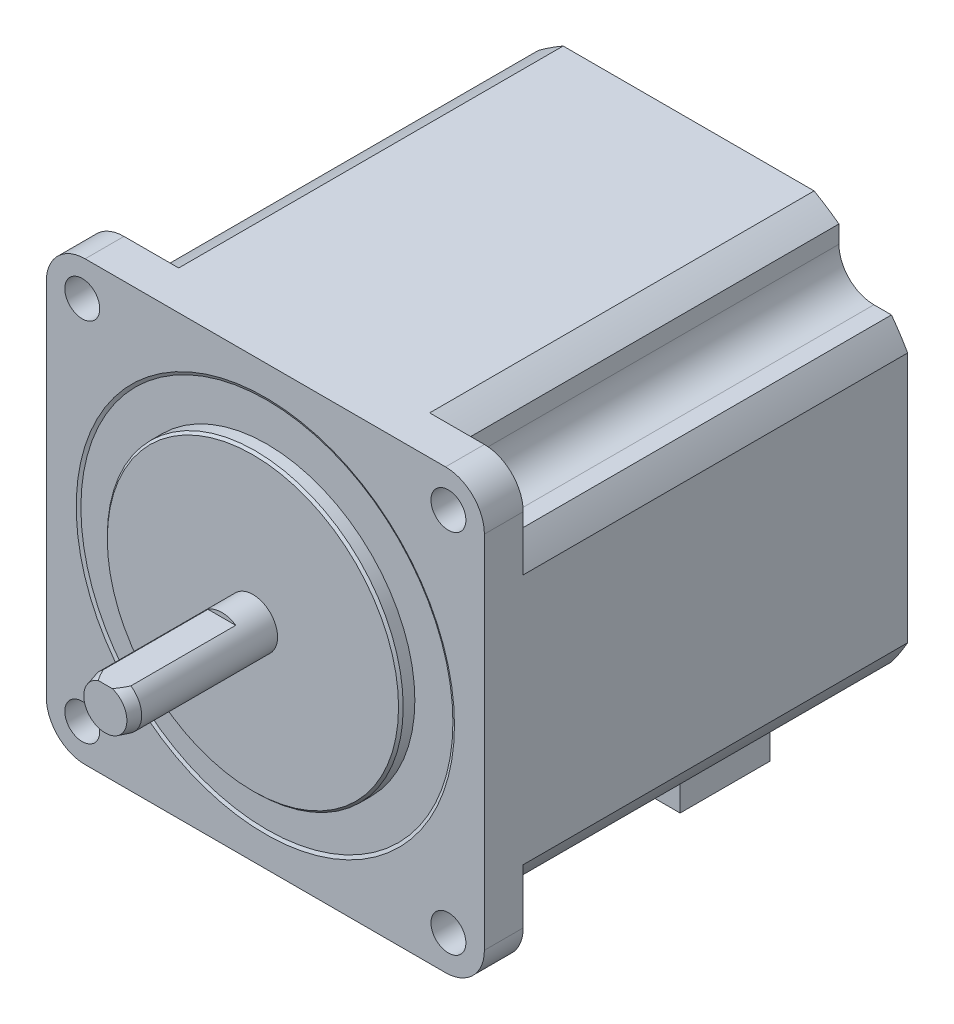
ISO-10303-21;
HEADER;
FILE_DESCRIPTION(('STEP AP214'),'2;1');
FILE_NAME('part.step','',(''),(''),'','','');
FILE_SCHEMA(('AUTOMOTIVE_DESIGN { 1 0 10303 214 1 1 1 1 }'));
ENDSEC;
DATA;
#1=APPLICATION_CONTEXT('core data for automotive mechanical design processes');
#2=APPLICATION_PROTOCOL_DEFINITION('international standard','automotive_design',2000,#1);
#3=PRODUCT_CONTEXT('',#1,'mechanical');
#4=PRODUCT('Part','Part','',(#3));
#5=PRODUCT_RELATED_PRODUCT_CATEGORY('part','',(#4));
#6=PRODUCT_DEFINITION_FORMATION('','',#4);
#7=PRODUCT_DEFINITION_CONTEXT('part definition',#1,'design');
#8=PRODUCT_DEFINITION('design','',#6,#7);
#9=PRODUCT_DEFINITION_SHAPE('','',#8);
#10=(LENGTH_UNIT() NAMED_UNIT(*) SI_UNIT(.MILLI.,.METRE.));
#11=(NAMED_UNIT(*) PLANE_ANGLE_UNIT() SI_UNIT($,.RADIAN.));
#12=(NAMED_UNIT(*) SI_UNIT($,.STERADIAN.) SOLID_ANGLE_UNIT());
#13=UNCERTAINTY_MEASURE_WITH_UNIT(LENGTH_MEASURE(1.E-05),#10,'distance_accuracy_value','');
#14=(GEOMETRIC_REPRESENTATION_CONTEXT(3) GLOBAL_UNCERTAINTY_ASSIGNED_CONTEXT((#13)) GLOBAL_UNIT_ASSIGNED_CONTEXT((#10,
#11,#12)) REPRESENTATION_CONTEXT('',''));
#15=CARTESIAN_POINT('',(0.,0.,0.));
#16=DIRECTION('',(0.,0.,1.));
#17=DIRECTION('',(1.,0.,0.));
#18=AXIS2_PLACEMENT_3D('',#15,#16,#17);
#19=CARTESIAN_POINT('',(0.,0.,19.));
#20=DIRECTION('',(0.,0.,-1.));
#21=DIRECTION('',(-1.,0.,0.));
#22=AXIS2_PLACEMENT_3D('',#19,#20,#21);
#23=CYLINDRICAL_SURFACE('',#22,3.175);
#24=CARTESIAN_POINT('',(0.,0.,17.5));
#25=DIRECTION('',(0.,0.,1.));
#26=DIRECTION('',(1.,0.,0.));
#27=AXIS2_PLACEMENT_3D('',#24,#25,#26);
#28=CIRCLE('',#27,3.175);
#29=CARTESIAN_POINT('',(1.78605710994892,2.625,17.5000000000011));
#30=VERTEX_POINT('',#29);
#31=CARTESIAN_POINT('',(-1.78605710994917,2.625,17.5));
#32=VERTEX_POINT('',#31);
#33=EDGE_CURVE('E310',#30,#32,#28,.F.);
#34=ORIENTED_EDGE('',*,*,#33,.T.);
#35=DIRECTION('',(0.,0.,-1.));
#36=VECTOR('',#35,1.);
#37=CARTESIAN_POINT('',(-1.78605710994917,2.625,19.));
#38=LINE('',#37,#36);
#39=CARTESIAN_POINT('',(-1.78605710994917,2.625,4.));
#40=VERTEX_POINT('',#39);
#41=EDGE_CURVE('E294',#32,#40,#38,.T.);
#42=ORIENTED_EDGE('',*,*,#41,.T.);
#43=CARTESIAN_POINT('',(0.,0.,4.));
#44=DIRECTION('',(0.,0.,1.));
#45=DIRECTION('',(1.,0.,0.));
#46=AXIS2_PLACEMENT_3D('',#43,#44,#45);
#47=CIRCLE('',#46,3.175);
#48=CARTESIAN_POINT('',(1.78605710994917,2.625,4.));
#49=VERTEX_POINT('',#48);
#50=EDGE_CURVE('E299',#49,#40,#47,.T.);
#51=ORIENTED_EDGE('',*,*,#50,.F.);
#52=DIRECTION('',(0.,0.,-1.));
#53=VECTOR('',#52,1.);
#54=CARTESIAN_POINT('',(1.78605710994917,2.625,19.));
#55=LINE('',#54,#53);
#56=EDGE_CURVE('E1236',#49,#30,#55,.F.);
#57=ORIENTED_EDGE('',*,*,#56,.T.);
#58=EDGE_LOOP('',(#34,#42,#51,#57));
#59=FACE_BOUND('',#58,.T.);
#60=CARTESIAN_POINT('',(0.,0.,0.));
#61=DIRECTION('',(0.,0.,-1.));
#62=DIRECTION('',(-1.,0.,0.));
#63=AXIS2_PLACEMENT_3D('',#60,#61,#62);
#64=CIRCLE('',#63,3.175);
#65=CARTESIAN_POINT('',(-3.175,0.,0.));
#66=VERTEX_POINT('',#65);
#67=EDGE_CURVE('E755',#66,#66,#64,.T.);
#68=ORIENTED_EDGE('',*,*,#67,.F.);
#69=EDGE_LOOP('',(#68));
#70=FACE_BOUND('',#69,.T.);
#71=ADVANCED_FACE('F39',(#59,#70),#23,.T.);
#72=CARTESIAN_POINT('',(0.,0.,19.));
#73=DIRECTION('',(0.,0.,1.));
#74=DIRECTION('',(1.,0.,0.));
#75=AXIS2_PLACEMENT_3D('',#72,#73,#74);
#76=PLANE('',#75);
#77=DIRECTION('',(1.,0.,0.));
#78=VECTOR('',#77,1.);
#79=CARTESIAN_POINT('',(-4.72781232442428,2.625,19.));
#80=LINE('',#79,#78);
#81=CARTESIAN_POINT('',(-0.894050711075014,2.625,19.));
#82=VERTEX_POINT('',#81);
#83=CARTESIAN_POINT('',(0.894050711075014,2.625,19.));
#84=VERTEX_POINT('',#83);
#85=EDGE_CURVE('E54',#82,#84,#80,.T.);
#86=ORIENTED_EDGE('',*,*,#85,.F.);
#87=CARTESIAN_POINT('',(0.,0.,19.));
#88=DIRECTION('',(0.,0.,1.));
#89=DIRECTION('',(1.,0.,0.));
#90=AXIS2_PLACEMENT_3D('',#87,#88,#89);
#91=CIRCLE('',#90,2.77307621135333);
#92=EDGE_CURVE('E305',#82,#84,#91,.T.);
#93=ORIENTED_EDGE('',*,*,#92,.T.);
#94=EDGE_LOOP('',(#86,#93));
#95=FACE_BOUND('',#94,.T.);
#96=ADVANCED_FACE('F304',(#95),#76,.T.);
#97=CARTESIAN_POINT('',(0.,0.,0.));
#98=DIRECTION('',(0.,0.,-1.));
#99=DIRECTION('',(-1.,0.,0.));
#100=AXIS2_PLACEMENT_3D('',#97,#98,#99);
#101=PLANE('',#100);
#102=CARTESIAN_POINT('',(0.,0.,0.));
#103=DIRECTION('',(0.,0.,-1.));
#104=DIRECTION('',(-1.,0.,0.));
#105=AXIS2_PLACEMENT_3D('',#102,#103,#104);
#106=CIRCLE('',#105,18.75);
#107=CARTESIAN_POINT('',(-18.75,0.,0.));
#108=VERTEX_POINT('',#107);
#109=EDGE_CURVE('E11',#108,#108,#106,.F.);
#110=ORIENTED_EDGE('',*,*,#109,.T.);
#111=EDGE_LOOP('',(#110));
#112=FACE_BOUND('',#111,.T.);
#113=ORIENTED_EDGE('',*,*,#67,.T.);
#114=EDGE_LOOP('',(#113));
#115=FACE_BOUND('',#114,.T.);
#116=ADVANCED_FACE('F445',(#112,#115),#101,.F.);
#117=CARTESIAN_POINT('',(0.,0.,-1.6));
#118=DIRECTION('',(0.,0.,1.));
#119=DIRECTION('',(1.,0.,0.));
#120=AXIS2_PLACEMENT_3D('',#117,#118,#119);
#121=CYLINDRICAL_SURFACE('',#120,19.05);
#122=CARTESIAN_POINT('',(0.,0.,-0.300000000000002));
#123=DIRECTION('',(0.,0.,-1.));
#124=DIRECTION('',(-1.,0.,0.));
#125=AXIS2_PLACEMENT_3D('',#122,#123,#124);
#126=CIRCLE('',#125,19.05);
#127=CARTESIAN_POINT('',(-19.05,0.,-0.300000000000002));
#128=VERTEX_POINT('',#127);
#129=EDGE_CURVE('E47',#128,#128,#126,.T.);
#130=ORIENTED_EDGE('',*,*,#129,.T.);
#131=EDGE_LOOP('',(#130));
#132=FACE_BOUND('',#131,.T.);
#133=CARTESIAN_POINT('',(0.,0.,-1.8));
#134=DIRECTION('',(0.,0.,1.));
#135=DIRECTION('',(1.,0.,0.));
#136=AXIS2_PLACEMENT_3D('',#133,#134,#135);
#137=CIRCLE('',#136,19.05);
#138=CARTESIAN_POINT('',(19.05,0.,-1.8));
#139=VERTEX_POINT('',#138);
#140=EDGE_CURVE('E1269',#139,#139,#137,.T.);
#141=ORIENTED_EDGE('',*,*,#140,.T.);
#142=EDGE_LOOP('',(#141));
#143=FACE_BOUND('',#142,.T.);
#144=ADVANCED_FACE('F448',(#132,#143),#121,.T.);
#145=CARTESIAN_POINT('',(0.,0.,19.));
#146=DIRECTION('',(0.,0.,-1.));
#147=DIRECTION('',(-1.,0.,0.));
#148=AXIS2_PLACEMENT_3D('',#145,#146,#147);
#149=CONICAL_SURFACE('',#148,2.77307621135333,0.261799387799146);
#150=CARTESIAN_POINT('',(-3.30935894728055,2.625,13.5849436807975));
#151=CARTESIAN_POINT('',(-3.24542473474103,2.625,13.7718399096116));
#152=CARTESIAN_POINT('',(-3.180873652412,2.625,13.9585279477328));
#153=CARTESIAN_POINT('',(-3.05023975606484,2.625,14.3313889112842));
#154=CARTESIAN_POINT('',(-2.98415678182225,2.625,14.5175617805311));
#155=CARTESIAN_POINT('',(-2.85014549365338,2.625,14.8893346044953));
#156=CARTESIAN_POINT('',(-2.7822163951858,2.625,15.0749342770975));
#157=CARTESIAN_POINT('',(-2.64413585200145,2.625,15.4452951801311));
#158=CARTESIAN_POINT('',(-2.57398453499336,2.625,15.630056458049));
#159=CARTESIAN_POINT('',(-2.43088450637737,2.625,15.9985625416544));
#160=CARTESIAN_POINT('',(-2.35793492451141,2.625,16.1823070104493));
#161=CARTESIAN_POINT('',(-2.2084743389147,2.625,16.5483836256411));
#162=CARTESIAN_POINT('',(-2.13196278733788,2.625,16.730715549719));
#163=CARTESIAN_POINT('',(-1.97412292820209,2.625,17.0936282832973));
#164=CARTESIAN_POINT('',(-1.89278731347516,2.625,17.2742059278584));
#165=CARTESIAN_POINT('',(-1.72367545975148,2.625,17.6322943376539));
#166=CARTESIAN_POINT('',(-1.63590163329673,2.625,17.8098062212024));
#167=CARTESIAN_POINT('',(-1.49689402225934,2.625,18.0727010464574));
#168=CARTESIAN_POINT('',(-1.44921905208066,2.625,18.159961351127));
#169=CARTESIAN_POINT('',(-1.35081442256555,2.625,18.3328001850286));
#170=CARTESIAN_POINT('',(-1.3000836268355,2.625,18.4183780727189));
#171=CARTESIAN_POINT('',(-1.19492866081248,2.625,18.5868191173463));
#172=CARTESIAN_POINT('',(-1.14051856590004,2.625,18.6696910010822));
#173=CARTESIAN_POINT('',(-1.02665023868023,2.625,18.8318604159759));
#174=CARTESIAN_POINT('',(-0.967196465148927,2.625,18.9111610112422));
#175=CARTESIAN_POINT('',(-0.862242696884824,2.625,19.0387203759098));
#176=CARTESIAN_POINT('',(-0.818661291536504,2.625,19.0885458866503));
#177=CARTESIAN_POINT('',(-0.727513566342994,2.625,19.1846578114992));
#178=CARTESIAN_POINT('',(-0.679939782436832,2.625,19.2309372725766));
#179=CARTESIAN_POINT('',(-0.579402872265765,2.625,19.3185048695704));
#180=CARTESIAN_POINT('',(-0.526387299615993,2.625,19.3597339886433));
#181=CARTESIAN_POINT('',(-0.414507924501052,2.625,19.4333493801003));
#182=CARTESIAN_POINT('',(-0.355665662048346,2.625,19.4657666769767));
#183=CARTESIAN_POINT('',(-0.254920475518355,2.625,19.5076037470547));
#184=CARTESIAN_POINT('',(-0.214733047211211,2.625,19.5210971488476));
#185=CARTESIAN_POINT('',(-0.132696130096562,2.625,19.5413023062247));
#186=CARTESIAN_POINT('',(-0.0908493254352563,2.625,19.5480245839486));
#187=CARTESIAN_POINT('',(-0.00641419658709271,2.625,19.5538691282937));
#188=CARTESIAN_POINT('',(0.0361766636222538,2.625,19.5529560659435));
#189=CARTESIAN_POINT('',(0.120530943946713,2.625,19.5435732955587));
#190=CARTESIAN_POINT('',(0.162293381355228,2.625,19.5350951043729));
#191=CARTESIAN_POINT('',(0.254092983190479,2.625,19.5086701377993));
#192=CARTESIAN_POINT('',(0.303590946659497,2.625,19.488887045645));
#193=CARTESIAN_POINT('',(0.398827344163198,2.625,19.441778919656));
#194=CARTESIAN_POINT('',(0.444557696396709,2.625,19.4144381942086));
#195=CARTESIAN_POINT('',(0.528152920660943,2.625,19.3573624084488));
#196=CARTESIAN_POINT('',(0.566351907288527,2.625,19.328105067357));
#197=CARTESIAN_POINT('',(0.640136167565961,2.625,19.266433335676));
#198=CARTESIAN_POINT('',(0.67571899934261,2.625,19.2340160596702));
#199=CARTESIAN_POINT('',(0.744720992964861,2.625,19.166764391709));
#200=CARTESIAN_POINT('',(0.778132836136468,2.625,19.1319225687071));
#201=CARTESIAN_POINT('',(0.842993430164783,2.625,19.0605004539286));
#202=CARTESIAN_POINT('',(0.874443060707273,2.625,19.0239209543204));
#203=CARTESIAN_POINT('',(0.960526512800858,2.625,18.9192141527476));
#204=CARTESIAN_POINT('',(1.01328788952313,2.625,18.8495504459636));
#205=CARTESIAN_POINT('',(1.11474355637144,2.625,18.7073019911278));
#206=CARTESIAN_POINT('',(1.16343498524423,2.625,18.6347152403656));
#207=CARTESIAN_POINT('',(1.25772470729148,2.625,18.487351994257));
#208=CARTESIAN_POINT('',(1.30331615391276,2.625,18.4125711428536));
#209=CARTESIAN_POINT('',(1.39194135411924,2.625,18.2615031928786));
#210=CARTESIAN_POINT('',(1.43497467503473,2.625,18.185215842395));
#211=CARTESIAN_POINT('',(1.56162993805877,2.625,17.9534626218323));
#212=CARTESIAN_POINT('',(1.64208680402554,2.625,17.7962698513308));
#213=CARTESIAN_POINT('',(1.79705705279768,2.625,17.4792970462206));
#214=CARTESIAN_POINT('',(1.87157841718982,2.625,17.3195208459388));
#215=CARTESIAN_POINT('',(2.01054641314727,2.625,17.0108615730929));
#216=CARTESIAN_POINT('',(2.07532251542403,2.625,16.8621261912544));
#217=CARTESIAN_POINT('',(2.20202359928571,2.625,16.56344277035));
#218=CARTESIAN_POINT('',(2.26394842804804,2.625,16.4134946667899));
#219=CARTESIAN_POINT('',(2.44641955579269,2.625,15.9620477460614));
#220=CARTESIAN_POINT('',(2.56356197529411,2.625,15.6591749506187));
#221=CARTESIAN_POINT('',(2.78774888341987,2.625,15.0616544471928));
#222=CARTESIAN_POINT('',(2.89500244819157,2.625,14.7670842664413));
#223=CARTESIAN_POINT('',(3.05264619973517,2.625,14.3242983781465));
#224=CARTESIAN_POINT('',(3.10462177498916,2.625,14.1766447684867));
#225=CARTESIAN_POINT('',(3.20764960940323,2.625,13.8810202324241));
#226=CARTESIAN_POINT('',(3.25870189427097,2.625,13.733049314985));
#227=CARTESIAN_POINT('',(3.30935894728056,2.625,13.5849436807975));
#228=B_SPLINE_CURVE_WITH_KNOTS('',3,(#150,#151,#152,#153,#154,#155,#156,#157,#158,#159,#160,
#161,#162,#163,#164,#165,#166,#167,#168,#169,#170,#171,#172,#173,#174,#175,#176,#177,#178,#179,
#180,#181,#182,#183,#184,#185,#186,#187,#188,#189,#190,#191,#192,#193,#194,#195,#196,#197,#198,
#199,#200,#201,#202,#203,#204,#205,#206,#207,#208,#209,#210,#211,#212,#213,#214,#215,#216,#217,
#218,#219,#220,#221,#222,#223,#224,#225,#226,#227),.UNSPECIFIED.,.F.,.F.,(4,2,2,2,2,2,2,2,2,2,2,
2,2,2,2,2,2,2,2,2,2,2,2,2,2,2,2,2,2,2,2,2,2,2,2,2,2,2,4),(0.,0.592590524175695,1.18524331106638,
1.77815202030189,2.37102671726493,2.964087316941,3.55723943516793,4.15131417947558,
4.74516743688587,5.04342777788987,5.34179972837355,5.6390885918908,5.9361173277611,
6.13455567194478,6.33337364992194,6.53432931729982,6.7345680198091,6.86126706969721,
6.98776892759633,7.11485643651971,7.24208663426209,7.40110146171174,7.56044895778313,
7.70458491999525,7.84885375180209,7.99358608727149,8.13825306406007,8.40019160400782,
8.66231276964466,8.92499521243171,9.18772195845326,9.71727649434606,10.2461064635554,
10.7327538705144,11.2194273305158,12.1935231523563,13.133951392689,13.6035521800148,
14.0731398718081),.UNSPECIFIED.);
#229=EDGE_CURVE('E290',#32,#82,#228,.T.);
#230=ORIENTED_EDGE('',*,*,#229,.F.);
#231=ORIENTED_EDGE('',*,*,#33,.F.);
#232=EDGE_CURVE('E300',#84,#30,#228,.T.);
#233=ORIENTED_EDGE('',*,*,#232,.F.);
#234=ORIENTED_EDGE('',*,*,#92,.F.);
#235=EDGE_LOOP('',(#230,#231,#233,#234));
#236=FACE_BOUND('',#235,.T.);
#237=ADVANCED_FACE('F309',(#236),#149,.T.);
#238=CARTESIAN_POINT('',(0.,0.,4.));
#239=DIRECTION('',(0.,0.,1.));
#240=DIRECTION('',(1.,0.,0.));
#241=AXIS2_PLACEMENT_3D('',#238,#239,#240);
#242=PLANE('',#241);
#243=ORIENTED_EDGE('',*,*,#50,.T.);
#244=DIRECTION('',(1.,0.,0.));
#245=VECTOR('',#244,1.);
#246=CARTESIAN_POINT('',(-4.72781232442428,2.625,4.));
#247=LINE('',#246,#245);
#248=EDGE_CURVE('E306',#40,#49,#247,.T.);
#249=ORIENTED_EDGE('',*,*,#248,.T.);
#250=EDGE_LOOP('',(#243,#249));
#251=FACE_BOUND('',#250,.T.);
#252=ADVANCED_FACE('F331',(#251),#242,.T.);
#253=CARTESIAN_POINT('',(-4.72781232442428,2.625,4.));
#254=DIRECTION('',(0.,-1.,0.));
#255=DIRECTION('',(0.,0.,-1.));
#256=AXIS2_PLACEMENT_3D('',#253,#254,#255);
#257=PLANE('',#256);
#258=ORIENTED_EDGE('',*,*,#229,.T.);
#259=ORIENTED_EDGE('',*,*,#85,.T.);
#260=ORIENTED_EDGE('',*,*,#232,.T.);
#261=ORIENTED_EDGE('',*,*,#56,.F.);
#262=ORIENTED_EDGE('',*,*,#248,.F.);
#263=ORIENTED_EDGE('',*,*,#41,.F.);
#264=EDGE_LOOP('',(#258,#259,#260,#261,#262,#263));
#265=FACE_BOUND('',#264,.T.);
#266=ADVANCED_FACE('F291',(#265),#257,.F.);
#267=CARTESIAN_POINT('',(0.,0.,-1.8));
#268=DIRECTION('',(0.,0.,1.));
#269=DIRECTION('',(1.,0.,0.));
#270=AXIS2_PLACEMENT_3D('',#267,#268,#269);
#271=PLANE('',#270);
#272=CARTESIAN_POINT('',(0.,0.,-1.8));
#273=DIRECTION('',(0.,0.,1.));
#274=DIRECTION('',(1.,0.,0.));
#275=AXIS2_PLACEMENT_3D('',#272,#273,#274);
#276=CIRCLE('',#275,23.95);
#277=CARTESIAN_POINT('',(23.95,0.,-1.8));
#278=VERTEX_POINT('',#277);
#279=EDGE_CURVE('E1230',#278,#278,#276,.T.);
#280=ORIENTED_EDGE('',*,*,#279,.T.);
#281=EDGE_LOOP('',(#280));
#282=FACE_BOUND('',#281,.T.);
#283=ORIENTED_EDGE('',*,*,#140,.F.);
#284=EDGE_LOOP('',(#283));
#285=FACE_BOUND('',#284,.T.);
#286=ADVANCED_FACE('F330',(#282,#285),#271,.T.);
#287=CARTESIAN_POINT('',(0.,-19.35,-56.1));
#288=DIRECTION('',(0.,1.,0.));
#289=DIRECTION('',(-1.,0.,0.));
#290=AXIS2_PLACEMENT_3D('',#287,#288,#289);
#291=PLANE('',#290);
#292=DIRECTION('',(-1.,0.,0.));
#293=VECTOR('',#292,1.);
#294=CARTESIAN_POINT('',(0.,-19.35,-56.1));
#295=LINE('',#294,#293);
#296=CARTESIAN_POINT('',(-23.85,-19.35,-56.1));
#297=VERTEX_POINT('',#296);
#298=CARTESIAN_POINT('',(-26.1118268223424,-19.35,-56.1));
#299=VERTEX_POINT('',#298);
#300=EDGE_CURVE('E523',#297,#299,#295,.T.);
#301=ORIENTED_EDGE('',*,*,#300,.F.);
#302=DIRECTION('',(0.,0.,1.));
#303=VECTOR('',#302,1.);
#304=CARTESIAN_POINT('',(-23.85,-19.35,-56.1));
#305=LINE('',#304,#303);
#306=CARTESIAN_POINT('',(-23.85,-19.35,-6.6));
#307=VERTEX_POINT('',#306);
#308=EDGE_CURVE('E592',#297,#307,#305,.T.);
#309=ORIENTED_EDGE('',*,*,#308,.T.);
#310=DIRECTION('',(-1.,0.,0.));
#311=VECTOR('',#310,1.);
#312=CARTESIAN_POINT('',(0.,-19.35,-6.6));
#313=LINE('',#312,#311);
#314=CARTESIAN_POINT('',(-26.1118268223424,-19.35,-6.6));
#315=VERTEX_POINT('',#314);
#316=EDGE_CURVE('E675',#307,#315,#313,.T.);
#317=ORIENTED_EDGE('',*,*,#316,.T.);
#318=DIRECTION('',(0.,0.,1.));
#319=VECTOR('',#318,1.);
#320=CARTESIAN_POINT('',(-26.1118268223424,-19.35,-56.1));
#321=LINE('',#320,#319);
#322=EDGE_CURVE('E677',#299,#315,#321,.T.);
#323=ORIENTED_EDGE('',*,*,#322,.F.);
#324=EDGE_LOOP('',(#301,#309,#317,#323));
#325=FACE_BOUND('',#324,.T.);
#326=ADVANCED_FACE('F363',(#325),#291,.F.);
#327=CARTESIAN_POINT('',(-23.85,-23.85,-56.1));
#328=DIRECTION('',(0.,0.,1.));
#329=DIRECTION('',(1.,0.,0.));
#330=AXIS2_PLACEMENT_3D('',#327,#328,#329);
#331=CYLINDRICAL_SURFACE('',#330,4.5);
#332=CARTESIAN_POINT('',(-23.85,-23.85,-56.1));
#333=DIRECTION('',(0.,0.,-1.));
#334=DIRECTION('',(-1.,0.,0.));
#335=AXIS2_PLACEMENT_3D('',#332,#333,#334);
#336=CIRCLE('',#335,4.5);
#337=CARTESIAN_POINT('',(-19.35,-23.85,-56.1));
#338=VERTEX_POINT('',#337);
#339=EDGE_CURVE('E612',#338,#297,#336,.F.);
#340=ORIENTED_EDGE('',*,*,#339,.F.);
#341=DIRECTION('',(0.,0.,1.));
#342=VECTOR('',#341,1.);
#343=CARTESIAN_POINT('',(-19.35,-23.85,-56.1));
#344=LINE('',#343,#342);
#345=CARTESIAN_POINT('',(-19.35,-23.85,-6.6));
#346=VERTEX_POINT('',#345);
#347=EDGE_CURVE('E597',#346,#338,#344,.F.);
#348=ORIENTED_EDGE('',*,*,#347,.F.);
#349=CARTESIAN_POINT('',(-23.85,-23.85,-6.6));
#350=DIRECTION('',(0.,0.,-1.));
#351=DIRECTION('',(-1.,0.,0.));
#352=AXIS2_PLACEMENT_3D('',#349,#350,#351);
#353=CIRCLE('',#352,4.5);
#354=EDGE_CURVE('E595',#307,#346,#353,.T.);
#355=ORIENTED_EDGE('',*,*,#354,.F.);
#356=ORIENTED_EDGE('',*,*,#308,.F.);
#357=EDGE_LOOP('',(#340,#348,#355,#356));
#358=FACE_BOUND('',#357,.T.);
#359=ADVANCED_FACE('F366',(#358),#331,.F.);
#360=CARTESIAN_POINT('',(-19.35,0.,-56.1));
#361=DIRECTION('',(-1.,0.,0.));
#362=DIRECTION('',(0.,-1.,0.));
#363=AXIS2_PLACEMENT_3D('',#360,#361,#362);
#364=PLANE('',#363);
#365=DIRECTION('',(0.,-1.,0.));
#366=VECTOR('',#365,1.);
#367=CARTESIAN_POINT('',(-19.35,0.,-6.6));
#368=LINE('',#367,#366);
#369=CARTESIAN_POINT('',(-19.35,-26.1118268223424,-6.6));
#370=VERTEX_POINT('',#369);
#371=EDGE_CURVE('E673',#346,#370,#368,.T.);
#372=ORIENTED_EDGE('',*,*,#371,.F.);
#373=ORIENTED_EDGE('',*,*,#347,.T.);
#374=DIRECTION('',(0.,-1.,0.));
#375=VECTOR('',#374,1.);
#376=CARTESIAN_POINT('',(-19.35,0.,-56.1));
#377=LINE('',#376,#375);
#378=CARTESIAN_POINT('',(-19.35,-26.1118268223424,-56.1));
#379=VERTEX_POINT('',#378);
#380=EDGE_CURVE('E521',#338,#379,#377,.T.);
#381=ORIENTED_EDGE('',*,*,#380,.T.);
#382=DIRECTION('',(0.,0.,1.));
#383=VECTOR('',#382,1.);
#384=CARTESIAN_POINT('',(-19.35,-26.1118268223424,-56.1));
#385=LINE('',#384,#383);
#386=EDGE_CURVE('E680',#379,#370,#385,.T.);
#387=ORIENTED_EDGE('',*,*,#386,.T.);
#388=EDGE_LOOP('',(#372,#373,#381,#387));
#389=FACE_BOUND('',#388,.T.);
#390=ADVANCED_FACE('F368',(#389),#364,.T.);
#391=CARTESIAN_POINT('',(-19.35,0.,-56.1));
#392=DIRECTION('',(-1.,0.,0.));
#393=DIRECTION('',(0.,0.,1.));
#394=AXIS2_PLACEMENT_3D('',#391,#392,#393);
#395=PLANE('',#394);
#396=DIRECTION('',(0.,-1.,0.));
#397=VECTOR('',#396,1.);
#398=CARTESIAN_POINT('',(-19.35,0.,-56.1));
#399=LINE('',#398,#397);
#400=CARTESIAN_POINT('',(-19.35,26.1118268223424,-56.1));
#401=VERTEX_POINT('',#400);
#402=CARTESIAN_POINT('',(-19.35,23.85,-56.1));
#403=VERTEX_POINT('',#402);
#404=EDGE_CURVE('E617',#401,#403,#399,.T.);
#405=ORIENTED_EDGE('',*,*,#404,.T.);
#406=DIRECTION('',(0.,0.,1.));
#407=VECTOR('',#406,1.);
#408=CARTESIAN_POINT('',(-19.35,23.85,-6.6));
#409=LINE('',#408,#407);
#410=CARTESIAN_POINT('',(-19.35,23.85,-6.6));
#411=VERTEX_POINT('',#410);
#412=EDGE_CURVE('E599',#403,#411,#409,.T.);
#413=ORIENTED_EDGE('',*,*,#412,.T.);
#414=DIRECTION('',(0.,-1.,0.));
#415=VECTOR('',#414,1.);
#416=CARTESIAN_POINT('',(-19.35,0.,-6.6));
#417=LINE('',#416,#415);
#418=CARTESIAN_POINT('',(-19.35,26.1118268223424,-6.6));
#419=VERTEX_POINT('',#418);
#420=EDGE_CURVE('E578',#419,#411,#417,.T.);
#421=ORIENTED_EDGE('',*,*,#420,.F.);
#422=DIRECTION('',(0.,0.,1.));
#423=VECTOR('',#422,1.);
#424=CARTESIAN_POINT('',(-19.35,26.1118268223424,-56.1));
#425=LINE('',#424,#423);
#426=EDGE_CURVE('E581',#401,#419,#425,.T.);
#427=ORIENTED_EDGE('',*,*,#426,.F.);
#428=EDGE_LOOP('',(#405,#413,#421,#427));
#429=FACE_BOUND('',#428,.T.);
#430=ADVANCED_FACE('F371',(#429),#395,.T.);
#431=CARTESIAN_POINT('',(-23.85,23.85,-56.1));
#432=DIRECTION('',(0.,0.,-1.));
#433=DIRECTION('',(-1.,0.,0.));
#434=AXIS2_PLACEMENT_3D('',#431,#432,#433);
#435=CYLINDRICAL_SURFACE('',#434,4.5);
#436=CARTESIAN_POINT('',(-23.85,23.85,-56.1));
#437=DIRECTION('',(0.,0.,-1.));
#438=DIRECTION('',(-1.,0.,0.));
#439=AXIS2_PLACEMENT_3D('',#436,#437,#438);
#440=CIRCLE('',#439,4.5);
#441=CARTESIAN_POINT('',(-23.85,19.35,-56.1));
#442=VERTEX_POINT('',#441);
#443=EDGE_CURVE('E314',#442,#403,#440,.F.);
#444=ORIENTED_EDGE('',*,*,#443,.F.);
#445=DIRECTION('',(0.,0.,1.));
#446=VECTOR('',#445,1.);
#447=CARTESIAN_POINT('',(-23.85,19.35,-56.1));
#448=LINE('',#447,#446);
#449=CARTESIAN_POINT('',(-23.85,19.35,-6.6));
#450=VERTEX_POINT('',#449);
#451=EDGE_CURVE('E604',#450,#442,#448,.F.);
#452=ORIENTED_EDGE('',*,*,#451,.F.);
#453=CARTESIAN_POINT('',(-23.85,23.85,-6.6));
#454=DIRECTION('',(0.,0.,-1.));
#455=DIRECTION('',(-1.,0.,0.));
#456=AXIS2_PLACEMENT_3D('',#453,#454,#455);
#457=CIRCLE('',#456,4.5);
#458=EDGE_CURVE('E602',#411,#450,#457,.T.);
#459=ORIENTED_EDGE('',*,*,#458,.F.);
#460=ORIENTED_EDGE('',*,*,#412,.F.);
#461=EDGE_LOOP('',(#444,#452,#459,#460));
#462=FACE_BOUND('',#461,.T.);
#463=ADVANCED_FACE('F391',(#462),#435,.F.);
#464=CARTESIAN_POINT('',(0.,19.3500000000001,-56.1));
#465=DIRECTION('',(0.,1.,0.));
#466=DIRECTION('',(-1.,0.,0.));
#467=AXIS2_PLACEMENT_3D('',#464,#465,#466);
#468=PLANE('',#467);
#469=DIRECTION('',(-1.,0.,0.));
#470=VECTOR('',#469,1.);
#471=CARTESIAN_POINT('',(0.,19.3500000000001,-6.6));
#472=LINE('',#471,#470);
#473=CARTESIAN_POINT('',(-26.1118268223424,19.35,-6.6));
#474=VERTEX_POINT('',#473);
#475=EDGE_CURVE('E528',#450,#474,#472,.T.);
#476=ORIENTED_EDGE('',*,*,#475,.F.);
#477=ORIENTED_EDGE('',*,*,#451,.T.);
#478=DIRECTION('',(-1.,0.,0.));
#479=VECTOR('',#478,1.);
#480=CARTESIAN_POINT('',(0.,19.3500000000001,-56.1));
#481=LINE('',#480,#479);
#482=CARTESIAN_POINT('',(-26.1118268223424,19.35,-56.1));
#483=VERTEX_POINT('',#482);
#484=EDGE_CURVE('E619',#442,#483,#481,.T.);
#485=ORIENTED_EDGE('',*,*,#484,.T.);
#486=DIRECTION('',(0.,0.,1.));
#487=VECTOR('',#486,1.);
#488=CARTESIAN_POINT('',(-26.1118268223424,19.35,-56.1));
#489=LINE('',#488,#487);
#490=EDGE_CURVE('E632',#483,#474,#489,.T.);
#491=ORIENTED_EDGE('',*,*,#490,.T.);
#492=EDGE_LOOP('',(#476,#477,#485,#491));
#493=FACE_BOUND('',#492,.T.);
#494=ADVANCED_FACE('F337',(#493),#468,.T.);
#495=CARTESIAN_POINT('',(0.,-38.2,0.));
#496=DIRECTION('',(0.,1.,0.));
#497=DIRECTION('',(0.,0.,1.));
#498=AXIS2_PLACEMENT_3D('',#495,#496,#497);
#499=PLANE('',#498);
#500=DIRECTION('',(0.,0.,-1.));
#501=VECTOR('',#500,1.);
#502=CARTESIAN_POINT('',(-10.5,-38.2,-56.1));
#503=LINE('',#502,#501);
#504=CARTESIAN_POINT('',(-10.5,-38.2,-44.5));
#505=VERTEX_POINT('',#504);
#506=CARTESIAN_POINT('',(-10.5,-38.2,-56.1));
#507=VERTEX_POINT('',#506);
#508=EDGE_CURVE('E1244',#505,#507,#503,.T.);
#509=ORIENTED_EDGE('',*,*,#508,.T.);
#510=DIRECTION('',(1.,0.,0.));
#511=VECTOR('',#510,1.);
#512=CARTESIAN_POINT('',(-10.5,-38.2,-56.1));
#513=LINE('',#512,#511);
#514=CARTESIAN_POINT('',(10.5,-38.2,-56.1));
#515=VERTEX_POINT('',#514);
#516=EDGE_CURVE('E1247',#507,#515,#513,.T.);
#517=ORIENTED_EDGE('',*,*,#516,.T.);
#518=DIRECTION('',(0.,0.,1.));
#519=VECTOR('',#518,1.);
#520=CARTESIAN_POINT('',(10.5,-38.2,-56.1));
#521=LINE('',#520,#519);
#522=CARTESIAN_POINT('',(10.5,-38.2,-44.5));
#523=VERTEX_POINT('',#522);
#524=EDGE_CURVE('E1250',#515,#523,#521,.T.);
#525=ORIENTED_EDGE('',*,*,#524,.T.);
#526=DIRECTION('',(-1.,0.,0.));
#527=VECTOR('',#526,1.);
#528=CARTESIAN_POINT('',(-10.5,-38.2,-44.5));
#529=LINE('',#528,#527);
#530=EDGE_CURVE('E1252',#523,#505,#529,.T.);
#531=ORIENTED_EDGE('',*,*,#530,.T.);
#532=EDGE_LOOP('',(#509,#517,#525,#531));
#533=FACE_BOUND('',#532,.T.);
#534=ADVANCED_FACE('F333',(#533),#499,.F.);
#535=CARTESIAN_POINT('',(19.35,0.,-56.1));
#536=DIRECTION('',(-1.,0.,0.));
#537=DIRECTION('',(0.,-1.,0.));
#538=AXIS2_PLACEMENT_3D('',#535,#536,#537);
#539=PLANE('',#538);
#540=DIRECTION('',(0.,-1.,0.));
#541=VECTOR('',#540,1.);
#542=CARTESIAN_POINT('',(19.35,0.,-6.6));
#543=LINE('',#542,#541);
#544=CARTESIAN_POINT('',(19.35,26.1118268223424,-6.6));
#545=VERTEX_POINT('',#544);
#546=CARTESIAN_POINT('',(19.35,23.85,-6.6));
#547=VERTEX_POINT('',#546);
#548=EDGE_CURVE('E567',#545,#547,#543,.T.);
#549=ORIENTED_EDGE('',*,*,#548,.T.);
#550=DIRECTION('',(0.,0.,1.));
#551=VECTOR('',#550,1.);
#552=CARTESIAN_POINT('',(19.35,23.85,-56.1));
#553=LINE('',#552,#551);
#554=CARTESIAN_POINT('',(19.35,23.85,-56.1));
#555=VERTEX_POINT('',#554);
#556=EDGE_CURVE('E485',#547,#555,#553,.F.);
#557=ORIENTED_EDGE('',*,*,#556,.T.);
#558=DIRECTION('',(0.,-1.,0.));
#559=VECTOR('',#558,1.);
#560=CARTESIAN_POINT('',(19.35,0.,-56.1));
#561=LINE('',#560,#559);
#562=CARTESIAN_POINT('',(19.35,26.1118268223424,-56.1));
#563=VERTEX_POINT('',#562);
#564=EDGE_CURVE('E494',#563,#555,#561,.T.);
#565=ORIENTED_EDGE('',*,*,#564,.F.);
#566=DIRECTION('',(0.,0.,1.));
#567=VECTOR('',#566,1.);
#568=CARTESIAN_POINT('',(19.35,26.1118268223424,-56.1));
#569=LINE('',#568,#567);
#570=EDGE_CURVE('E574',#563,#545,#569,.T.);
#571=ORIENTED_EDGE('',*,*,#570,.T.);
#572=EDGE_LOOP('',(#549,#557,#565,#571));
#573=FACE_BOUND('',#572,.T.);
#574=ADVANCED_FACE('F336',(#573),#539,.F.);
#575=CARTESIAN_POINT('',(23.85,23.85,-56.1));
#576=DIRECTION('',(0.,0.,1.));
#577=DIRECTION('',(1.,0.,0.));
#578=AXIS2_PLACEMENT_3D('',#575,#576,#577);
#579=CYLINDRICAL_SURFACE('',#578,4.5);
#580=CARTESIAN_POINT('',(23.85,23.85,-56.1));
#581=DIRECTION('',(0.,0.,-1.));
#582=DIRECTION('',(-1.,0.,0.));
#583=AXIS2_PLACEMENT_3D('',#580,#581,#582);
#584=CIRCLE('',#583,4.5);
#585=CARTESIAN_POINT('',(23.85,19.35,-56.1));
#586=VERTEX_POINT('',#585);
#587=EDGE_CURVE('E311',#555,#586,#584,.F.);
#588=ORIENTED_EDGE('',*,*,#587,.F.);
#589=ORIENTED_EDGE('',*,*,#556,.F.);
#590=CARTESIAN_POINT('',(23.85,23.85,-6.6));
#591=DIRECTION('',(0.,0.,-1.));
#592=DIRECTION('',(-1.,0.,0.));
#593=AXIS2_PLACEMENT_3D('',#590,#591,#592);
#594=CIRCLE('',#593,4.5);
#595=CARTESIAN_POINT('',(23.85,19.35,-6.6));
#596=VERTEX_POINT('',#595);
#597=EDGE_CURVE('E607',#596,#547,#594,.T.);
#598=ORIENTED_EDGE('',*,*,#597,.F.);
#599=DIRECTION('',(0.,0.,1.));
#600=VECTOR('',#599,1.);
#601=CARTESIAN_POINT('',(23.85,19.35,-56.1));
#602=LINE('',#601,#600);
#603=EDGE_CURVE('E487',#586,#596,#602,.T.);
#604=ORIENTED_EDGE('',*,*,#603,.F.);
#605=EDGE_LOOP('',(#588,#589,#598,#604));
#606=FACE_BOUND('',#605,.T.);
#607=ADVANCED_FACE('F384',(#606),#579,.F.);
#608=CARTESIAN_POINT('',(0.,19.3500000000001,-56.1));
#609=DIRECTION('',(0.,1.,0.));
#610=DIRECTION('',(-1.,0.,0.));
#611=AXIS2_PLACEMENT_3D('',#608,#609,#610);
#612=PLANE('',#611);
#613=DIRECTION('',(-1.,0.,0.));
#614=VECTOR('',#613,1.);
#615=CARTESIAN_POINT('',(0.,19.3500000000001,-56.1));
#616=LINE('',#615,#614);
#617=CARTESIAN_POINT('',(26.1118268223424,19.35,-56.1));
#618=VERTEX_POINT('',#617);
#619=EDGE_CURVE('E492',#618,#586,#616,.T.);
#620=ORIENTED_EDGE('',*,*,#619,.T.);
#621=ORIENTED_EDGE('',*,*,#603,.T.);
#622=DIRECTION('',(-1.,0.,0.));
#623=VECTOR('',#622,1.);
#624=CARTESIAN_POINT('',(0.,19.3500000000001,-6.6));
#625=LINE('',#624,#623);
#626=CARTESIAN_POINT('',(26.1118268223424,19.35,-6.6));
#627=VERTEX_POINT('',#626);
#628=EDGE_CURVE('E664',#627,#596,#625,.T.);
#629=ORIENTED_EDGE('',*,*,#628,.F.);
#630=DIRECTION('',(0.,0.,1.));
#631=VECTOR('',#630,1.);
#632=CARTESIAN_POINT('',(26.1118268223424,19.35,-56.1));
#633=LINE('',#632,#631);
#634=EDGE_CURVE('E498',#618,#627,#633,.T.);
#635=ORIENTED_EDGE('',*,*,#634,.F.);
#636=EDGE_LOOP('',(#620,#621,#629,#635));
#637=FACE_BOUND('',#636,.T.);
#638=ADVANCED_FACE('F380',(#637),#612,.T.);
#639=CARTESIAN_POINT('',(0.,-19.3499999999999,-56.1));
#640=DIRECTION('',(0.,1.,0.));
#641=DIRECTION('',(-1.,0.,0.));
#642=AXIS2_PLACEMENT_3D('',#639,#640,#641);
#643=PLANE('',#642);
#644=DIRECTION('',(-1.,0.,0.));
#645=VECTOR('',#644,1.);
#646=CARTESIAN_POINT('',(0.,-19.3499999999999,-6.6));
#647=LINE('',#646,#645);
#648=CARTESIAN_POINT('',(26.1118268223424,-19.35,-6.6));
#649=VERTEX_POINT('',#648);
#650=CARTESIAN_POINT('',(23.85,-19.35,-6.6));
#651=VERTEX_POINT('',#650);
#652=EDGE_CURVE('E668',#649,#651,#647,.T.);
#653=ORIENTED_EDGE('',*,*,#652,.T.);
#654=DIRECTION('',(0.,0.,1.));
#655=VECTOR('',#654,1.);
#656=CARTESIAN_POINT('',(23.85,-19.35,-56.1));
#657=LINE('',#656,#655);
#658=CARTESIAN_POINT('',(23.85,-19.35,-56.1));
#659=VERTEX_POINT('',#658);
#660=EDGE_CURVE('E590',#651,#659,#657,.F.);
#661=ORIENTED_EDGE('',*,*,#660,.T.);
#662=DIRECTION('',(-1.,0.,0.));
#663=VECTOR('',#662,1.);
#664=CARTESIAN_POINT('',(0.,-19.3499999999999,-56.1));
#665=LINE('',#664,#663);
#666=CARTESIAN_POINT('',(26.1118268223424,-19.35,-56.1));
#667=VERTEX_POINT('',#666);
#668=EDGE_CURVE('E510',#667,#659,#665,.T.);
#669=ORIENTED_EDGE('',*,*,#668,.F.);
#670=DIRECTION('',(0.,0.,1.));
#671=VECTOR('',#670,1.);
#672=CARTESIAN_POINT('',(26.1118268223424,-19.35,-56.1));
#673=LINE('',#672,#671);
#674=EDGE_CURVE('E688',#667,#649,#673,.T.);
#675=ORIENTED_EDGE('',*,*,#674,.T.);
#676=EDGE_LOOP('',(#653,#661,#669,#675));
#677=FACE_BOUND('',#676,.T.);
#678=ADVANCED_FACE('F377',(#677),#643,.F.);
#679=CARTESIAN_POINT('',(23.85,-23.85,-56.1));
#680=DIRECTION('',(0.,0.,-1.));
#681=DIRECTION('',(-1.,0.,0.));
#682=AXIS2_PLACEMENT_3D('',#679,#680,#681);
#683=CYLINDRICAL_SURFACE('',#682,4.5);
#684=CARTESIAN_POINT('',(23.85,-23.85,-56.1));
#685=DIRECTION('',(0.,0.,-1.));
#686=DIRECTION('',(-1.,0.,0.));
#687=AXIS2_PLACEMENT_3D('',#684,#685,#686);
#688=CIRCLE('',#687,4.5);
#689=CARTESIAN_POINT('',(19.35,-23.85,-56.1));
#690=VERTEX_POINT('',#689);
#691=EDGE_CURVE('E610',#659,#690,#688,.F.);
#692=ORIENTED_EDGE('',*,*,#691,.F.);
#693=ORIENTED_EDGE('',*,*,#660,.F.);
#694=CARTESIAN_POINT('',(23.85,-23.85,-6.6));
#695=DIRECTION('',(0.,0.,-1.));
#696=DIRECTION('',(-1.,0.,0.));
#697=AXIS2_PLACEMENT_3D('',#694,#695,#696);
#698=CIRCLE('',#697,4.5);
#699=CARTESIAN_POINT('',(19.35,-23.85,-6.6));
#700=VERTEX_POINT('',#699);
#701=EDGE_CURVE('E587',#700,#651,#698,.T.);
#702=ORIENTED_EDGE('',*,*,#701,.F.);
#703=DIRECTION('',(0.,0.,1.));
#704=VECTOR('',#703,1.);
#705=CARTESIAN_POINT('',(19.35,-23.85,-6.6));
#706=LINE('',#705,#704);
#707=EDGE_CURVE('E584',#690,#700,#706,.T.);
#708=ORIENTED_EDGE('',*,*,#707,.F.);
#709=EDGE_LOOP('',(#692,#693,#702,#708));
#710=FACE_BOUND('',#709,.T.);
#711=ADVANCED_FACE('F375',(#710),#683,.F.);
#712=CARTESIAN_POINT('',(19.35,0.,-56.1));
#713=DIRECTION('',(-1.,0.,0.));
#714=DIRECTION('',(0.,-1.,0.));
#715=AXIS2_PLACEMENT_3D('',#712,#713,#714);
#716=PLANE('',#715);
#717=DIRECTION('',(0.,-1.,0.));
#718=VECTOR('',#717,1.);
#719=CARTESIAN_POINT('',(19.35,0.,-56.1));
#720=LINE('',#719,#718);
#721=CARTESIAN_POINT('',(19.35,-26.1118268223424,-56.1));
#722=VERTEX_POINT('',#721);
#723=EDGE_CURVE('E513',#690,#722,#720,.T.);
#724=ORIENTED_EDGE('',*,*,#723,.F.);
#725=ORIENTED_EDGE('',*,*,#707,.T.);
#726=DIRECTION('',(0.,-1.,0.));
#727=VECTOR('',#726,1.);
#728=CARTESIAN_POINT('',(19.35,0.,-6.6));
#729=LINE('',#728,#727);
#730=CARTESIAN_POINT('',(19.35,-26.1118268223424,-6.6));
#731=VERTEX_POINT('',#730);
#732=EDGE_CURVE('E671',#700,#731,#729,.T.);
#733=ORIENTED_EDGE('',*,*,#732,.T.);
#734=DIRECTION('',(0.,0.,1.));
#735=VECTOR('',#734,1.);
#736=CARTESIAN_POINT('',(19.35,-26.1118268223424,-56.1));
#737=LINE('',#736,#735);
#738=EDGE_CURVE('E685',#722,#731,#737,.T.);
#739=ORIENTED_EDGE('',*,*,#738,.F.);
#740=EDGE_LOOP('',(#724,#725,#733,#739));
#741=FACE_BOUND('',#740,.T.);
#742=ADVANCED_FACE('F360',(#741),#716,.F.);
#743=CARTESIAN_POINT('',(0.,0.,-56.1));
#744=DIRECTION('',(0.,0.,1.));
#745=DIRECTION('',(1.,0.,0.));
#746=AXIS2_PLACEMENT_3D('',#743,#744,#745);
#747=CYLINDRICAL_SURFACE('',#746,32.5);
#748=CARTESIAN_POINT('',(0.,0.,-6.6));
#749=DIRECTION('',(0.,0.,-1.));
#750=DIRECTION('',(-1.,0.,0.));
#751=AXIS2_PLACEMENT_3D('',#748,#749,#750);
#752=CIRCLE('',#751,32.5);
#753=CARTESIAN_POINT('',(-28.2,-16.1558039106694,-6.6));
#754=VERTEX_POINT('',#753);
#755=EDGE_CURVE('E533',#315,#754,#752,.T.);
#756=ORIENTED_EDGE('',*,*,#755,.T.);
#757=DIRECTION('',(0.,0.,1.));
#758=VECTOR('',#757,1.);
#759=CARTESIAN_POINT('',(-28.2,-16.1558039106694,-56.1));
#760=LINE('',#759,#758);
#761=CARTESIAN_POINT('',(-28.2,-16.1558039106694,-56.1));
#762=VERTEX_POINT('',#761);
#763=EDGE_CURVE('E681',#762,#754,#760,.T.);
#764=ORIENTED_EDGE('',*,*,#763,.F.);
#765=CARTESIAN_POINT('',(0.,0.,-56.1));
#766=DIRECTION('',(0.,0.,-1.));
#767=DIRECTION('',(-1.,0.,0.));
#768=AXIS2_PLACEMENT_3D('',#765,#766,#767);
#769=CIRCLE('',#768,32.5);
#770=EDGE_CURVE('E525',#299,#762,#769,.T.);
#771=ORIENTED_EDGE('',*,*,#770,.F.);
#772=ORIENTED_EDGE('',*,*,#322,.T.);
#773=EDGE_LOOP('',(#756,#764,#771,#772));
#774=FACE_BOUND('',#773,.T.);
#775=ADVANCED_FACE('F356',(#774),#747,.T.);
#776=CARTESIAN_POINT('',(-28.2,16.1558039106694,-6.6));
#777=VERTEX_POINT('',#776);
#778=EDGE_CURVE('E540',#777,#474,#752,.T.);
#779=ORIENTED_EDGE('',*,*,#778,.T.);
#780=ORIENTED_EDGE('',*,*,#490,.F.);
#781=CARTESIAN_POINT('',(-28.2,16.1558039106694,-56.1));
#782=VERTEX_POINT('',#781);
#783=EDGE_CURVE('E645',#782,#483,#769,.T.);
#784=ORIENTED_EDGE('',*,*,#783,.F.);
#785=DIRECTION('',(0.,0.,1.));
#786=VECTOR('',#785,1.);
#787=CARTESIAN_POINT('',(-28.2,16.1558039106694,-56.1));
#788=LINE('',#787,#786);
#789=EDGE_CURVE('E697',#782,#777,#788,.T.);
#790=ORIENTED_EDGE('',*,*,#789,.T.);
#791=EDGE_LOOP('',(#779,#780,#784,#790));
#792=FACE_BOUND('',#791,.T.);
#793=ADVANCED_FACE('F359',(#792),#747,.T.);
#794=CARTESIAN_POINT('',(-16.1558039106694,28.2,-6.6));
#795=VERTEX_POINT('',#794);
#796=EDGE_CURVE('E568',#419,#795,#752,.T.);
#797=ORIENTED_EDGE('',*,*,#796,.T.);
#798=DIRECTION('',(0.,0.,1.));
#799=VECTOR('',#798,1.);
#800=CARTESIAN_POINT('',(-16.1558039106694,28.2,-56.1));
#801=LINE('',#800,#799);
#802=CARTESIAN_POINT('',(-16.1558039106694,28.2,-56.1));
#803=VERTEX_POINT('',#802);
#804=EDGE_CURVE('E573',#803,#795,#801,.T.);
#805=ORIENTED_EDGE('',*,*,#804,.F.);
#806=EDGE_CURVE('E626',#401,#803,#769,.T.);
#807=ORIENTED_EDGE('',*,*,#806,.F.);
#808=ORIENTED_EDGE('',*,*,#426,.T.);
#809=EDGE_LOOP('',(#797,#805,#807,#808));
#810=FACE_BOUND('',#809,.T.);
#811=ADVANCED_FACE('F652',(#810),#747,.T.);
#812=CARTESIAN_POINT('',(16.1558039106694,28.2,-6.6));
#813=VERTEX_POINT('',#812);
#814=EDGE_CURVE('E563',#813,#545,#752,.T.);
#815=ORIENTED_EDGE('',*,*,#814,.T.);
#816=ORIENTED_EDGE('',*,*,#570,.F.);
#817=CARTESIAN_POINT('',(16.1558039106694,28.2,-56.1));
#818=VERTEX_POINT('',#817);
#819=EDGE_CURVE('E504',#818,#563,#769,.T.);
#820=ORIENTED_EDGE('',*,*,#819,.F.);
#821=DIRECTION('',(0.,0.,1.));
#822=VECTOR('',#821,1.);
#823=CARTESIAN_POINT('',(16.1558039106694,28.2,-56.1));
#824=LINE('',#823,#822);
#825=EDGE_CURVE('E570',#818,#813,#824,.T.);
#826=ORIENTED_EDGE('',*,*,#825,.T.);
#827=EDGE_LOOP('',(#815,#816,#820,#826));
#828=FACE_BOUND('',#827,.T.);
#829=ADVANCED_FACE('F420',(#828),#747,.T.);
#830=CARTESIAN_POINT('',(-28.2,-28.2,-6.6));
#831=DIRECTION('',(0.,0.,-1.));
#832=DIRECTION('',(-1.,0.,0.));
#833=AXIS2_PLACEMENT_3D('',#830,#831,#832);
#834=PLANE('',#833);
#835=ORIENTED_EDGE('',*,*,#420,.T.);
#836=ORIENTED_EDGE('',*,*,#458,.T.);
#837=ORIENTED_EDGE('',*,*,#475,.T.);
#838=ORIENTED_EDGE('',*,*,#778,.F.);
#839=DIRECTION('',(0.,1.,0.));
#840=VECTOR('',#839,1.);
#841=CARTESIAN_POINT('',(-28.2,28.2,-6.6));
#842=LINE('',#841,#840);
#843=CARTESIAN_POINT('',(-28.2,23.2,-6.6));
#844=VERTEX_POINT('',#843);
#845=EDGE_CURVE('E729',#777,#844,#842,.T.);
#846=ORIENTED_EDGE('',*,*,#845,.T.);
#847=CARTESIAN_POINT('',(-23.2,23.2,-6.6));
#848=DIRECTION('',(0.,0.,-1.));
#849=DIRECTION('',(-1.,0.,0.));
#850=AXIS2_PLACEMENT_3D('',#847,#848,#849);
#851=CIRCLE('',#850,5.);
#852=CARTESIAN_POINT('',(-23.2,28.2,-6.6));
#853=VERTEX_POINT('',#852);
#854=EDGE_CURVE('E780',#844,#853,#851,.T.);
#855=ORIENTED_EDGE('',*,*,#854,.T.);
#856=DIRECTION('',(1.,0.,0.));
#857=VECTOR('',#856,1.);
#858=CARTESIAN_POINT('',(28.2,28.2,-6.6));
#859=LINE('',#858,#857);
#860=EDGE_CURVE('E797',#853,#795,#859,.T.);
#861=ORIENTED_EDGE('',*,*,#860,.T.);
#862=ORIENTED_EDGE('',*,*,#796,.F.);
#863=EDGE_LOOP('',(#835,#836,#837,#838,#846,#855,#861,#862));
#864=FACE_BOUND('',#863,.T.);
#865=CARTESIAN_POINT('',(-23.57,23.57,-6.6));
#866=DIRECTION('',(0.,0.,-1.));
#867=DIRECTION('',(-1.,0.,0.));
#868=AXIS2_PLACEMENT_3D('',#865,#866,#867);
#869=CIRCLE('',#868,2.25);
#870=CARTESIAN_POINT('',(-25.82,23.57,-6.6));
#871=VERTEX_POINT('',#870);
#872=EDGE_CURVE('E717',#871,#871,#869,.T.);
#873=ORIENTED_EDGE('',*,*,#872,.F.);
#874=EDGE_LOOP('',(#873));
#875=FACE_BOUND('',#874,.T.);
#876=ADVANCED_FACE('F416',(#864,#875),#834,.T.);
#877=CARTESIAN_POINT('',(28.2,16.1558039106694,-6.6));
#878=VERTEX_POINT('',#877);
#879=EDGE_CURVE('E559',#627,#878,#752,.T.);
#880=ORIENTED_EDGE('',*,*,#879,.T.);
#881=DIRECTION('',(0.,0.,1.));
#882=VECTOR('',#881,1.);
#883=CARTESIAN_POINT('',(28.2,16.1558039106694,-56.1));
#884=LINE('',#883,#882);
#885=CARTESIAN_POINT('',(28.2,16.1558039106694,-56.1));
#886=VERTEX_POINT('',#885);
#887=EDGE_CURVE('E693',#886,#878,#884,.T.);
#888=ORIENTED_EDGE('',*,*,#887,.F.);
#889=EDGE_CURVE('E500',#618,#886,#769,.T.);
#890=ORIENTED_EDGE('',*,*,#889,.F.);
#891=ORIENTED_EDGE('',*,*,#634,.T.);
#892=EDGE_LOOP('',(#880,#888,#890,#891));
#893=FACE_BOUND('',#892,.T.);
#894=ADVANCED_FACE('F419',(#893),#747,.T.);
#895=CARTESIAN_POINT('',(28.2,-16.1558039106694,-6.6));
#896=VERTEX_POINT('',#895);
#897=EDGE_CURVE('E555',#896,#649,#752,.T.);
#898=ORIENTED_EDGE('',*,*,#897,.T.);
#899=ORIENTED_EDGE('',*,*,#674,.F.);
#900=CARTESIAN_POINT('',(28.2,-16.1558039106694,-56.1));
#901=VERTEX_POINT('',#900);
#902=EDGE_CURVE('E505',#901,#667,#769,.T.);
#903=ORIENTED_EDGE('',*,*,#902,.F.);
#904=DIRECTION('',(0.,0.,1.));
#905=VECTOR('',#904,1.);
#906=CARTESIAN_POINT('',(28.2,-16.1558039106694,-56.1));
#907=LINE('',#906,#905);
#908=EDGE_CURVE('E692',#901,#896,#907,.T.);
#909=ORIENTED_EDGE('',*,*,#908,.T.);
#910=EDGE_LOOP('',(#898,#899,#903,#909));
#911=FACE_BOUND('',#910,.T.);
#912=ADVANCED_FACE('F860',(#911),#747,.T.);
#913=CARTESIAN_POINT('',(-16.1558039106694,-28.2,-6.6));
#914=VERTEX_POINT('',#913);
#915=EDGE_CURVE('E545',#914,#370,#752,.T.);
#916=ORIENTED_EDGE('',*,*,#915,.T.);
#917=ORIENTED_EDGE('',*,*,#386,.F.);
#918=CARTESIAN_POINT('',(-16.1558039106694,-28.2,-56.1));
#919=VERTEX_POINT('',#918);
#920=EDGE_CURVE('E519',#919,#379,#769,.T.);
#921=ORIENTED_EDGE('',*,*,#920,.F.);
#922=DIRECTION('',(0.,0.,1.));
#923=VECTOR('',#922,1.);
#924=CARTESIAN_POINT('',(-16.1558039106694,-28.2,-56.1));
#925=LINE('',#924,#923);
#926=EDGE_CURVE('E684',#919,#914,#925,.T.);
#927=ORIENTED_EDGE('',*,*,#926,.T.);
#928=EDGE_LOOP('',(#916,#917,#921,#927));
#929=FACE_BOUND('',#928,.T.);
#930=ADVANCED_FACE('F362',(#929),#747,.T.);
#931=ORIENTED_EDGE('',*,*,#316,.F.);
#932=ORIENTED_EDGE('',*,*,#354,.T.);
#933=ORIENTED_EDGE('',*,*,#371,.T.);
#934=ORIENTED_EDGE('',*,*,#915,.F.);
#935=DIRECTION('',(-1.,0.,0.));
#936=VECTOR('',#935,1.);
#937=CARTESIAN_POINT('',(28.2,-28.2,-6.6));
#938=LINE('',#937,#936);
#939=CARTESIAN_POINT('',(-23.2,-28.2,-6.6));
#940=VERTEX_POINT('',#939);
#941=EDGE_CURVE('E734',#914,#940,#938,.T.);
#942=ORIENTED_EDGE('',*,*,#941,.T.);
#943=CARTESIAN_POINT('',(-23.2,-23.2,-6.6));
#944=DIRECTION('',(0.,0.,-1.));
#945=DIRECTION('',(-1.,0.,0.));
#946=AXIS2_PLACEMENT_3D('',#943,#944,#945);
#947=CIRCLE('',#946,5.);
#948=CARTESIAN_POINT('',(-28.2,-23.2,-6.6));
#949=VERTEX_POINT('',#948);
#950=EDGE_CURVE('E782',#940,#949,#947,.T.);
#951=ORIENTED_EDGE('',*,*,#950,.T.);
#952=EDGE_CURVE('E732',#949,#754,#842,.T.);
#953=ORIENTED_EDGE('',*,*,#952,.T.);
#954=ORIENTED_EDGE('',*,*,#755,.F.);
#955=EDGE_LOOP('',(#931,#932,#933,#934,#942,#951,#953,#954));
#956=FACE_BOUND('',#955,.T.);
#957=CARTESIAN_POINT('',(-23.57,-23.57,-6.6));
#958=DIRECTION('',(0.,0.,-1.));
#959=DIRECTION('',(-1.,0.,0.));
#960=AXIS2_PLACEMENT_3D('',#957,#958,#959);
#961=CIRCLE('',#960,2.25);
#962=CARTESIAN_POINT('',(-25.82,-23.57,-6.6));
#963=VERTEX_POINT('',#962);
#964=EDGE_CURVE('E705',#963,#963,#961,.T.);
#965=ORIENTED_EDGE('',*,*,#964,.F.);
#966=EDGE_LOOP('',(#965));
#967=FACE_BOUND('',#966,.T.);
#968=ADVANCED_FACE('F422',(#956,#967),#834,.T.);
#969=CARTESIAN_POINT('',(16.1558039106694,-28.2,-6.6));
#970=VERTEX_POINT('',#969);
#971=EDGE_CURVE('E550',#731,#970,#752,.T.);
#972=ORIENTED_EDGE('',*,*,#971,.T.);
#973=DIRECTION('',(0.,0.,1.));
#974=VECTOR('',#973,1.);
#975=CARTESIAN_POINT('',(16.1558039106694,-28.2,-56.1));
#976=LINE('',#975,#974);
#977=CARTESIAN_POINT('',(16.1558039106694,-28.2,-56.1));
#978=VERTEX_POINT('',#977);
#979=EDGE_CURVE('E689',#978,#970,#976,.T.);
#980=ORIENTED_EDGE('',*,*,#979,.F.);
#981=EDGE_CURVE('E515',#722,#978,#769,.T.);
#982=ORIENTED_EDGE('',*,*,#981,.F.);
#983=ORIENTED_EDGE('',*,*,#738,.T.);
#984=EDGE_LOOP('',(#972,#980,#982,#983));
#985=FACE_BOUND('',#984,.T.);
#986=ADVANCED_FACE('F354',(#985),#747,.T.);
#987=CARTESIAN_POINT('',(0.,0.,-56.1));
#988=DIRECTION('',(0.,0.,-1.));
#989=DIRECTION('',(-1.,0.,0.));
#990=AXIS2_PLACEMENT_3D('',#987,#988,#989);
#991=PLANE('',#990);
#992=DIRECTION('',(0.,1.,0.));
#993=VECTOR('',#992,1.);
#994=CARTESIAN_POINT('',(-28.2,0.,-56.1));
#995=LINE('',#994,#993);
#996=EDGE_CURVE('E644',#762,#782,#995,.T.);
#997=ORIENTED_EDGE('',*,*,#996,.T.);
#998=ORIENTED_EDGE('',*,*,#783,.T.);
#999=ORIENTED_EDGE('',*,*,#484,.F.);
#1000=ORIENTED_EDGE('',*,*,#443,.T.);
#1001=ORIENTED_EDGE('',*,*,#404,.F.);
#1002=ORIENTED_EDGE('',*,*,#806,.T.);
#1003=DIRECTION('',(1.,0.,0.));
#1004=VECTOR('',#1003,1.);
#1005=CARTESIAN_POINT('',(0.,28.2,-56.1));
#1006=LINE('',#1005,#1004);
#1007=EDGE_CURVE('E647',#803,#818,#1006,.T.);
#1008=ORIENTED_EDGE('',*,*,#1007,.T.);
#1009=ORIENTED_EDGE('',*,*,#819,.T.);
#1010=ORIENTED_EDGE('',*,*,#564,.T.);
#1011=ORIENTED_EDGE('',*,*,#587,.T.);
#1012=ORIENTED_EDGE('',*,*,#619,.F.);
#1013=ORIENTED_EDGE('',*,*,#889,.T.);
#1014=DIRECTION('',(0.,-1.,0.));
#1015=VECTOR('',#1014,1.);
#1016=CARTESIAN_POINT('',(28.2,0.,-56.1));
#1017=LINE('',#1016,#1015);
#1018=EDGE_CURVE('E502',#886,#901,#1017,.T.);
#1019=ORIENTED_EDGE('',*,*,#1018,.T.);
#1020=ORIENTED_EDGE('',*,*,#902,.T.);
#1021=ORIENTED_EDGE('',*,*,#668,.T.);
#1022=ORIENTED_EDGE('',*,*,#691,.T.);
#1023=ORIENTED_EDGE('',*,*,#723,.T.);
#1024=ORIENTED_EDGE('',*,*,#981,.T.);
#1025=DIRECTION('',(-1.,0.,0.));
#1026=VECTOR('',#1025,1.);
#1027=CARTESIAN_POINT('',(0.,-28.2,-56.1));
#1028=LINE('',#1027,#1026);
#1029=CARTESIAN_POINT('',(10.5,-28.2,-56.1));
#1030=VERTEX_POINT('',#1029);
#1031=EDGE_CURVE('E516',#978,#1030,#1028,.T.);
#1032=ORIENTED_EDGE('',*,*,#1031,.T.);
#1033=DIRECTION('',(0.,1.,0.));
#1034=VECTOR('',#1033,1.);
#1035=CARTESIAN_POINT('',(10.5,-38.2,-56.1));
#1036=LINE('',#1035,#1034);
#1037=EDGE_CURVE('E637',#515,#1030,#1036,.T.);
#1038=ORIENTED_EDGE('',*,*,#1037,.F.);
#1039=ORIENTED_EDGE('',*,*,#516,.F.);
#1040=DIRECTION('',(0.,1.,0.));
#1041=VECTOR('',#1040,1.);
#1042=CARTESIAN_POINT('',(-10.5,-38.2,-56.1));
#1043=LINE('',#1042,#1041);
#1044=CARTESIAN_POINT('',(-10.5,-28.2,-56.1));
#1045=VERTEX_POINT('',#1044);
#1046=EDGE_CURVE('E634',#507,#1045,#1043,.T.);
#1047=ORIENTED_EDGE('',*,*,#1046,.T.);
#1048=EDGE_CURVE('E520',#1045,#919,#1028,.T.);
#1049=ORIENTED_EDGE('',*,*,#1048,.T.);
#1050=ORIENTED_EDGE('',*,*,#920,.T.);
#1051=ORIENTED_EDGE('',*,*,#380,.F.);
#1052=ORIENTED_EDGE('',*,*,#339,.T.);
#1053=ORIENTED_EDGE('',*,*,#300,.T.);
#1054=ORIENTED_EDGE('',*,*,#770,.T.);
#1055=EDGE_LOOP('',(#997,#998,#999,#1000,#1001,#1002,#1008,#1009,#1010,#1011,#1012,#1013,#1019,
#1020,#1021,#1022,#1023,#1024,#1032,#1038,#1039,#1047,#1049,#1050,#1051,#1052,#1053,#1054));
#1056=FACE_BOUND('',#1055,.T.);
#1057=ADVANCED_FACE('F347',(#1056),#991,.T.);
#1058=CARTESIAN_POINT('',(10.5,-38.2,-56.1));
#1059=DIRECTION('',(-1.,0.,0.));
#1060=DIRECTION('',(0.,0.,1.));
#1061=AXIS2_PLACEMENT_3D('',#1058,#1059,#1060);
#1062=PLANE('',#1061);
#1063=DIRECTION('',(0.,0.,1.));
#1064=VECTOR('',#1063,1.);
#1065=CARTESIAN_POINT('',(10.5,-28.2,-56.1));
#1066=LINE('',#1065,#1064);
#1067=CARTESIAN_POINT('',(10.5,-28.2,-44.5));
#1068=VERTEX_POINT('',#1067);
#1069=EDGE_CURVE('E1240',#1030,#1068,#1066,.T.);
#1070=ORIENTED_EDGE('',*,*,#1069,.T.);
#1071=DIRECTION('',(0.,1.,0.));
#1072=VECTOR('',#1071,1.);
#1073=CARTESIAN_POINT('',(10.5,-38.2,-44.5));
#1074=LINE('',#1073,#1072);
#1075=EDGE_CURVE('E640',#523,#1068,#1074,.T.);
#1076=ORIENTED_EDGE('',*,*,#1075,.F.);
#1077=ORIENTED_EDGE('',*,*,#524,.F.);
#1078=ORIENTED_EDGE('',*,*,#1037,.T.);
#1079=EDGE_LOOP('',(#1070,#1076,#1077,#1078));
#1080=FACE_BOUND('',#1079,.T.);
#1081=ADVANCED_FACE('F343',(#1080),#1062,.F.);
#1082=CARTESIAN_POINT('',(-10.5,-38.2,-44.5));
#1083=DIRECTION('',(0.,0.,-1.));
#1084=DIRECTION('',(-1.,0.,0.));
#1085=AXIS2_PLACEMENT_3D('',#1082,#1083,#1084);
#1086=PLANE('',#1085);
#1087=DIRECTION('',(-1.,0.,0.));
#1088=VECTOR('',#1087,1.);
#1089=CARTESIAN_POINT('',(-10.5,-28.2,-44.5));
#1090=LINE('',#1089,#1088);
#1091=CARTESIAN_POINT('',(-10.5,-28.2,-44.5));
#1092=VERTEX_POINT('',#1091);
#1093=EDGE_CURVE('E1248',#1068,#1092,#1090,.T.);
#1094=ORIENTED_EDGE('',*,*,#1093,.T.);
#1095=DIRECTION('',(0.,1.,0.));
#1096=VECTOR('',#1095,1.);
#1097=CARTESIAN_POINT('',(-10.5,-38.2,-44.5));
#1098=LINE('',#1097,#1096);
#1099=EDGE_CURVE('E1253',#505,#1092,#1098,.T.);
#1100=ORIENTED_EDGE('',*,*,#1099,.F.);
#1101=ORIENTED_EDGE('',*,*,#530,.F.);
#1102=ORIENTED_EDGE('',*,*,#1075,.T.);
#1103=EDGE_LOOP('',(#1094,#1100,#1101,#1102));
#1104=FACE_BOUND('',#1103,.T.);
#1105=ADVANCED_FACE('F339',(#1104),#1086,.F.);
#1106=CARTESIAN_POINT('',(-10.5,-38.2,-56.1));
#1107=DIRECTION('',(1.,0.,0.));
#1108=DIRECTION('',(0.,0.,-1.));
#1109=AXIS2_PLACEMENT_3D('',#1106,#1107,#1108);
#1110=PLANE('',#1109);
#1111=DIRECTION('',(0.,0.,-1.));
#1112=VECTOR('',#1111,1.);
#1113=CARTESIAN_POINT('',(-10.5,-28.2,-56.1));
#1114=LINE('',#1113,#1112);
#1115=EDGE_CURVE('E62',#1092,#1045,#1114,.T.);
#1116=ORIENTED_EDGE('',*,*,#1115,.T.);
#1117=ORIENTED_EDGE('',*,*,#1046,.F.);
#1118=ORIENTED_EDGE('',*,*,#508,.F.);
#1119=ORIENTED_EDGE('',*,*,#1099,.T.);
#1120=EDGE_LOOP('',(#1116,#1117,#1118,#1119));
#1121=FACE_BOUND('',#1120,.T.);
#1122=ADVANCED_FACE('F342',(#1121),#1110,.F.);
#1123=ORIENTED_EDGE('',*,*,#628,.T.);
#1124=ORIENTED_EDGE('',*,*,#597,.T.);
#1125=ORIENTED_EDGE('',*,*,#548,.F.);
#1126=ORIENTED_EDGE('',*,*,#814,.F.);
#1127=CARTESIAN_POINT('',(23.2,28.2,-6.6));
#1128=VERTEX_POINT('',#1127);
#1129=EDGE_CURVE('E657',#813,#1128,#859,.T.);
#1130=ORIENTED_EDGE('',*,*,#1129,.T.);
#1131=CARTESIAN_POINT('',(23.2,23.2,-6.6));
#1132=DIRECTION('',(0.,0.,-1.));
#1133=DIRECTION('',(-1.,0.,0.));
#1134=AXIS2_PLACEMENT_3D('',#1131,#1132,#1133);
#1135=CIRCLE('',#1134,5.);
#1136=CARTESIAN_POINT('',(28.2,23.2,-6.6));
#1137=VERTEX_POINT('',#1136);
#1138=EDGE_CURVE('E778',#1128,#1137,#1135,.T.);
#1139=ORIENTED_EDGE('',*,*,#1138,.T.);
#1140=DIRECTION('',(0.,-1.,0.));
#1141=VECTOR('',#1140,1.);
#1142=CARTESIAN_POINT('',(28.2,28.2,-6.6));
#1143=LINE('',#1142,#1141);
#1144=EDGE_CURVE('E738',#1137,#878,#1143,.T.);
#1145=ORIENTED_EDGE('',*,*,#1144,.T.);
#1146=ORIENTED_EDGE('',*,*,#879,.F.);
#1147=EDGE_LOOP('',(#1123,#1124,#1125,#1126,#1130,#1139,#1145,#1146));
#1148=FACE_BOUND('',#1147,.T.);
#1149=CARTESIAN_POINT('',(23.57,23.57,-6.6));
#1150=DIRECTION('',(0.,0.,-1.));
#1151=DIRECTION('',(-1.,0.,0.));
#1152=AXIS2_PLACEMENT_3D('',#1149,#1150,#1151);
#1153=CIRCLE('',#1152,2.25);
#1154=CARTESIAN_POINT('',(21.32,23.57,-6.6));
#1155=VERTEX_POINT('',#1154);
#1156=EDGE_CURVE('E711',#1155,#1155,#1153,.T.);
#1157=ORIENTED_EDGE('',*,*,#1156,.F.);
#1158=EDGE_LOOP('',(#1157));
#1159=FACE_BOUND('',#1158,.T.);
#1160=ADVANCED_FACE('F351',(#1148,#1159),#834,.T.);
#1161=ORIENTED_EDGE('',*,*,#732,.F.);
#1162=ORIENTED_EDGE('',*,*,#701,.T.);
#1163=ORIENTED_EDGE('',*,*,#652,.F.);
#1164=ORIENTED_EDGE('',*,*,#897,.F.);
#1165=CARTESIAN_POINT('',(28.2,-23.2,-6.6));
#1166=VERTEX_POINT('',#1165);
#1167=EDGE_CURVE('E796',#896,#1166,#1143,.T.);
#1168=ORIENTED_EDGE('',*,*,#1167,.T.);
#1169=CARTESIAN_POINT('',(23.2,-23.2,-6.6));
#1170=DIRECTION('',(0.,0.,-1.));
#1171=DIRECTION('',(-1.,0.,0.));
#1172=AXIS2_PLACEMENT_3D('',#1169,#1170,#1171);
#1173=CIRCLE('',#1172,5.);
#1174=CARTESIAN_POINT('',(23.2,-28.2,-6.6));
#1175=VERTEX_POINT('',#1174);
#1176=EDGE_CURVE('E784',#1166,#1175,#1173,.T.);
#1177=ORIENTED_EDGE('',*,*,#1176,.T.);
#1178=EDGE_CURVE('E737',#1175,#970,#938,.T.);
#1179=ORIENTED_EDGE('',*,*,#1178,.T.);
#1180=ORIENTED_EDGE('',*,*,#971,.F.);
#1181=EDGE_LOOP('',(#1161,#1162,#1163,#1164,#1168,#1177,#1179,#1180));
#1182=FACE_BOUND('',#1181,.T.);
#1183=CARTESIAN_POINT('',(23.57,-23.57,-6.6));
#1184=DIRECTION('',(0.,0.,-1.));
#1185=DIRECTION('',(-1.,0.,0.));
#1186=AXIS2_PLACEMENT_3D('',#1183,#1184,#1185);
#1187=CIRCLE('',#1186,2.25);
#1188=CARTESIAN_POINT('',(21.32,-23.57,-6.6));
#1189=VERTEX_POINT('',#1188);
#1190=EDGE_CURVE('E698',#1189,#1189,#1187,.T.);
#1191=ORIENTED_EDGE('',*,*,#1190,.F.);
#1192=EDGE_LOOP('',(#1191));
#1193=FACE_BOUND('',#1192,.T.);
#1194=ADVANCED_FACE('F406',(#1182,#1193),#834,.T.);
#1195=CARTESIAN_POINT('',(-23.57,-23.57,-6.6));
#1196=DIRECTION('',(0.,0.,1.));
#1197=DIRECTION('',(1.,0.,0.));
#1198=AXIS2_PLACEMENT_3D('',#1195,#1196,#1197);
#1199=CYLINDRICAL_SURFACE('',#1198,2.25);
#1200=ORIENTED_EDGE('',*,*,#964,.T.);
#1201=EDGE_LOOP('',(#1200));
#1202=FACE_BOUND('',#1201,.T.);
#1203=CARTESIAN_POINT('',(-23.57,-23.57,-1.6));
#1204=DIRECTION('',(0.,0.,-1.));
#1205=DIRECTION('',(-1.,0.,0.));
#1206=AXIS2_PLACEMENT_3D('',#1203,#1204,#1205);
#1207=CIRCLE('',#1206,2.25);
#1208=CARTESIAN_POINT('',(-25.82,-23.57,-1.6));
#1209=VERTEX_POINT('',#1208);
#1210=EDGE_CURVE('E701',#1209,#1209,#1207,.T.);
#1211=ORIENTED_EDGE('',*,*,#1210,.F.);
#1212=EDGE_LOOP('',(#1211));
#1213=FACE_BOUND('',#1212,.T.);
#1214=ADVANCED_FACE('F402',(#1202,#1213),#1199,.F.);
#1215=CARTESIAN_POINT('',(-23.57,23.57,-6.6));
#1216=DIRECTION('',(0.,0.,1.));
#1217=DIRECTION('',(1.,0.,0.));
#1218=AXIS2_PLACEMENT_3D('',#1215,#1216,#1217);
#1219=CYLINDRICAL_SURFACE('',#1218,2.25);
#1220=ORIENTED_EDGE('',*,*,#872,.T.);
#1221=EDGE_LOOP('',(#1220));
#1222=FACE_BOUND('',#1221,.T.);
#1223=CARTESIAN_POINT('',(-23.57,23.57,-1.6));
#1224=DIRECTION('',(0.,0.,-1.));
#1225=DIRECTION('',(-1.,0.,0.));
#1226=AXIS2_PLACEMENT_3D('',#1223,#1224,#1225);
#1227=CIRCLE('',#1226,2.25);
#1228=CARTESIAN_POINT('',(-25.82,23.57,-1.6));
#1229=VERTEX_POINT('',#1228);
#1230=EDGE_CURVE('E714',#1229,#1229,#1227,.T.);
#1231=ORIENTED_EDGE('',*,*,#1230,.F.);
#1232=EDGE_LOOP('',(#1231));
#1233=FACE_BOUND('',#1232,.T.);
#1234=ADVANCED_FACE('F405',(#1222,#1233),#1219,.F.);
#1235=CARTESIAN_POINT('',(-23.2,-23.2,-6.6));
#1236=DIRECTION('',(0.,0.,1.));
#1237=DIRECTION('',(1.,0.,0.));
#1238=AXIS2_PLACEMENT_3D('',#1235,#1236,#1237);
#1239=CYLINDRICAL_SURFACE('',#1238,5.);
#1240=ORIENTED_EDGE('',*,*,#950,.F.);
#1241=DIRECTION('',(0.,0.,1.));
#1242=VECTOR('',#1241,1.);
#1243=CARTESIAN_POINT('',(-23.2,-28.2,-6.6));
#1244=LINE('',#1243,#1242);
#1245=CARTESIAN_POINT('',(-23.2,-28.2,-1.6));
#1246=VERTEX_POINT('',#1245);
#1247=EDGE_CURVE('E758',#1246,#940,#1244,.F.);
#1248=ORIENTED_EDGE('',*,*,#1247,.F.);
#1249=CARTESIAN_POINT('',(-23.2,-23.2,-1.6));
#1250=DIRECTION('',(0.,0.,-1.));
#1251=DIRECTION('',(-1.,0.,0.));
#1252=AXIS2_PLACEMENT_3D('',#1249,#1250,#1251);
#1253=CIRCLE('',#1252,5.);
#1254=CARTESIAN_POINT('',(-28.2,-23.2,-1.6));
#1255=VERTEX_POINT('',#1254);
#1256=EDGE_CURVE('E768',#1255,#1246,#1253,.F.);
#1257=ORIENTED_EDGE('',*,*,#1256,.F.);
#1258=DIRECTION('',(0.,0.,1.));
#1259=VECTOR('',#1258,1.);
#1260=CARTESIAN_POINT('',(-28.2,-23.2,-6.6));
#1261=LINE('',#1260,#1259);
#1262=EDGE_CURVE('E789',#949,#1255,#1261,.T.);
#1263=ORIENTED_EDGE('',*,*,#1262,.F.);
#1264=EDGE_LOOP('',(#1240,#1248,#1257,#1263));
#1265=FACE_BOUND('',#1264,.T.);
#1266=ADVANCED_FACE('F414',(#1265),#1239,.T.);
#1267=CARTESIAN_POINT('',(-28.2,28.2,-6.6));
#1268=DIRECTION('',(1.,0.,0.));
#1269=DIRECTION('',(0.,1.,0.));
#1270=AXIS2_PLACEMENT_3D('',#1267,#1268,#1269);
#1271=PLANE('',#1270);
#1272=ORIENTED_EDGE('',*,*,#952,.F.);
#1273=ORIENTED_EDGE('',*,*,#1262,.T.);
#1274=DIRECTION('',(0.,1.,0.));
#1275=VECTOR('',#1274,1.);
#1276=CARTESIAN_POINT('',(-28.2,28.2,-1.6));
#1277=LINE('',#1276,#1275);
#1278=CARTESIAN_POINT('',(-28.2,23.2,-1.6));
#1279=VERTEX_POINT('',#1278);
#1280=EDGE_CURVE('E720',#1255,#1279,#1277,.T.);
#1281=ORIENTED_EDGE('',*,*,#1280,.T.);
#1282=DIRECTION('',(0.,0.,1.));
#1283=VECTOR('',#1282,1.);
#1284=CARTESIAN_POINT('',(-28.2,23.2,-6.6));
#1285=LINE('',#1284,#1283);
#1286=EDGE_CURVE('E786',#1279,#844,#1285,.F.);
#1287=ORIENTED_EDGE('',*,*,#1286,.T.);
#1288=ORIENTED_EDGE('',*,*,#845,.F.);
#1289=ORIENTED_EDGE('',*,*,#789,.F.);
#1290=ORIENTED_EDGE('',*,*,#996,.F.);
#1291=ORIENTED_EDGE('',*,*,#763,.T.);
#1292=EDGE_LOOP('',(#1272,#1273,#1281,#1287,#1288,#1289,#1290,#1291));
#1293=FACE_BOUND('',#1292,.T.);
#1294=ADVANCED_FACE('F441',(#1293),#1271,.F.);
#1295=CARTESIAN_POINT('',(-23.2,23.2,-6.6));
#1296=DIRECTION('',(0.,0.,1.));
#1297=DIRECTION('',(1.,0.,0.));
#1298=AXIS2_PLACEMENT_3D('',#1295,#1296,#1297);
#1299=CYLINDRICAL_SURFACE('',#1298,5.);
#1300=ORIENTED_EDGE('',*,*,#854,.F.);
#1301=ORIENTED_EDGE('',*,*,#1286,.F.);
#1302=CARTESIAN_POINT('',(-23.2,23.2,-1.6));
#1303=DIRECTION('',(0.,0.,-1.));
#1304=DIRECTION('',(-1.,0.,0.));
#1305=AXIS2_PLACEMENT_3D('',#1302,#1303,#1304);
#1306=CIRCLE('',#1305,5.);
#1307=CARTESIAN_POINT('',(-23.2,28.2,-1.6));
#1308=VERTEX_POINT('',#1307);
#1309=EDGE_CURVE('E766',#1308,#1279,#1306,.F.);
#1310=ORIENTED_EDGE('',*,*,#1309,.F.);
#1311=DIRECTION('',(0.,0.,1.));
#1312=VECTOR('',#1311,1.);
#1313=CARTESIAN_POINT('',(-23.2,28.2,-6.6));
#1314=LINE('',#1313,#1312);
#1315=EDGE_CURVE('E588',#853,#1308,#1314,.T.);
#1316=ORIENTED_EDGE('',*,*,#1315,.F.);
#1317=EDGE_LOOP('',(#1300,#1301,#1310,#1316));
#1318=FACE_BOUND('',#1317,.T.);
#1319=ADVANCED_FACE('F439',(#1318),#1299,.T.);
#1320=CARTESIAN_POINT('',(28.2,28.2,-6.6));
#1321=DIRECTION('',(0.,-1.,0.));
#1322=DIRECTION('',(0.,0.,-1.));
#1323=AXIS2_PLACEMENT_3D('',#1320,#1321,#1322);
#1324=PLANE('',#1323);
#1325=ORIENTED_EDGE('',*,*,#860,.F.);
#1326=ORIENTED_EDGE('',*,*,#1315,.T.);
#1327=DIRECTION('',(1.,0.,0.));
#1328=VECTOR('',#1327,1.);
#1329=CARTESIAN_POINT('',(28.2,28.2,-1.6));
#1330=LINE('',#1329,#1328);
#1331=CARTESIAN_POINT('',(23.2,28.2,-1.6));
#1332=VERTEX_POINT('',#1331);
#1333=EDGE_CURVE('E746',#1308,#1332,#1330,.T.);
#1334=ORIENTED_EDGE('',*,*,#1333,.T.);
#1335=DIRECTION('',(0.,0.,1.));
#1336=VECTOR('',#1335,1.);
#1337=CARTESIAN_POINT('',(23.2,28.2,-6.6));
#1338=LINE('',#1337,#1336);
#1339=EDGE_CURVE('E792',#1332,#1128,#1338,.F.);
#1340=ORIENTED_EDGE('',*,*,#1339,.T.);
#1341=ORIENTED_EDGE('',*,*,#1129,.F.);
#1342=ORIENTED_EDGE('',*,*,#825,.F.);
#1343=ORIENTED_EDGE('',*,*,#1007,.F.);
#1344=ORIENTED_EDGE('',*,*,#804,.T.);
#1345=EDGE_LOOP('',(#1325,#1326,#1334,#1340,#1341,#1342,#1343,#1344));
#1346=FACE_BOUND('',#1345,.T.);
#1347=ADVANCED_FACE('F436',(#1346),#1324,.F.);
#1348=CARTESIAN_POINT('',(23.2,23.2,-6.6));
#1349=DIRECTION('',(0.,0.,1.));
#1350=DIRECTION('',(1.,0.,0.));
#1351=AXIS2_PLACEMENT_3D('',#1348,#1349,#1350);
#1352=CYLINDRICAL_SURFACE('',#1351,5.);
#1353=ORIENTED_EDGE('',*,*,#1138,.F.);
#1354=ORIENTED_EDGE('',*,*,#1339,.F.);
#1355=CARTESIAN_POINT('',(23.2,23.2,-1.6));
#1356=DIRECTION('',(0.,0.,-1.));
#1357=DIRECTION('',(-1.,0.,0.));
#1358=AXIS2_PLACEMENT_3D('',#1355,#1356,#1357);
#1359=CIRCLE('',#1358,5.);
#1360=CARTESIAN_POINT('',(28.2,23.2,-1.6));
#1361=VERTEX_POINT('',#1360);
#1362=EDGE_CURVE('E764',#1361,#1332,#1359,.F.);
#1363=ORIENTED_EDGE('',*,*,#1362,.F.);
#1364=DIRECTION('',(0.,0.,1.));
#1365=VECTOR('',#1364,1.);
#1366=CARTESIAN_POINT('',(28.2,23.2,-6.6));
#1367=LINE('',#1366,#1365);
#1368=EDGE_CURVE('E772',#1137,#1361,#1367,.T.);
#1369=ORIENTED_EDGE('',*,*,#1368,.F.);
#1370=EDGE_LOOP('',(#1353,#1354,#1363,#1369));
#1371=FACE_BOUND('',#1370,.T.);
#1372=ADVANCED_FACE('F434',(#1371),#1352,.T.);
#1373=CARTESIAN_POINT('',(28.2,28.2,-6.6));
#1374=DIRECTION('',(-1.,0.,0.));
#1375=DIRECTION('',(0.,-1.,0.));
#1376=AXIS2_PLACEMENT_3D('',#1373,#1374,#1375);
#1377=PLANE('',#1376);
#1378=DIRECTION('',(0.,-1.,0.));
#1379=VECTOR('',#1378,1.);
#1380=CARTESIAN_POINT('',(28.2,28.2,-1.6));
#1381=LINE('',#1380,#1379);
#1382=CARTESIAN_POINT('',(28.2,-23.2,-1.6));
#1383=VERTEX_POINT('',#1382);
#1384=EDGE_CURVE('E749',#1361,#1383,#1381,.T.);
#1385=ORIENTED_EDGE('',*,*,#1384,.T.);
#1386=DIRECTION('',(0.,0.,1.));
#1387=VECTOR('',#1386,1.);
#1388=CARTESIAN_POINT('',(28.2,-23.2,-6.6));
#1389=LINE('',#1388,#1387);
#1390=EDGE_CURVE('E775',#1383,#1166,#1389,.F.);
#1391=ORIENTED_EDGE('',*,*,#1390,.T.);
#1392=ORIENTED_EDGE('',*,*,#1167,.F.);
#1393=ORIENTED_EDGE('',*,*,#908,.F.);
#1394=ORIENTED_EDGE('',*,*,#1018,.F.);
#1395=ORIENTED_EDGE('',*,*,#887,.T.);
#1396=ORIENTED_EDGE('',*,*,#1144,.F.);
#1397=ORIENTED_EDGE('',*,*,#1368,.T.);
#1398=EDGE_LOOP('',(#1385,#1391,#1392,#1393,#1394,#1395,#1396,#1397));
#1399=FACE_BOUND('',#1398,.T.);
#1400=ADVANCED_FACE('F431',(#1399),#1377,.F.);
#1401=CARTESIAN_POINT('',(23.2,-23.2,-6.6));
#1402=DIRECTION('',(0.,0.,1.));
#1403=DIRECTION('',(1.,0.,0.));
#1404=AXIS2_PLACEMENT_3D('',#1401,#1402,#1403);
#1405=CYLINDRICAL_SURFACE('',#1404,5.);
#1406=ORIENTED_EDGE('',*,*,#1176,.F.);
#1407=ORIENTED_EDGE('',*,*,#1390,.F.);
#1408=CARTESIAN_POINT('',(23.2,-23.2,-1.6));
#1409=DIRECTION('',(0.,0.,-1.));
#1410=DIRECTION('',(-1.,0.,0.));
#1411=AXIS2_PLACEMENT_3D('',#1408,#1409,#1410);
#1412=CIRCLE('',#1411,5.);
#1413=CARTESIAN_POINT('',(23.2,-28.2,-1.6));
#1414=VERTEX_POINT('',#1413);
#1415=EDGE_CURVE('E770',#1414,#1383,#1412,.F.);
#1416=ORIENTED_EDGE('',*,*,#1415,.F.);
#1417=DIRECTION('',(0.,0.,1.));
#1418=VECTOR('',#1417,1.);
#1419=CARTESIAN_POINT('',(23.2,-28.2,-6.6));
#1420=LINE('',#1419,#1418);
#1421=EDGE_CURVE('E761',#1175,#1414,#1420,.T.);
#1422=ORIENTED_EDGE('',*,*,#1421,.F.);
#1423=EDGE_LOOP('',(#1406,#1407,#1416,#1422));
#1424=FACE_BOUND('',#1423,.T.);
#1425=ADVANCED_FACE('F429',(#1424),#1405,.T.);
#1426=CARTESIAN_POINT('',(28.2,-28.2,-6.6));
#1427=DIRECTION('',(0.,1.,0.));
#1428=DIRECTION('',(0.,0.,1.));
#1429=AXIS2_PLACEMENT_3D('',#1426,#1427,#1428);
#1430=PLANE('',#1429);
#1431=ORIENTED_EDGE('',*,*,#1115,.F.);
#1432=ORIENTED_EDGE('',*,*,#1093,.F.);
#1433=ORIENTED_EDGE('',*,*,#1069,.F.);
#1434=ORIENTED_EDGE('',*,*,#1031,.F.);
#1435=ORIENTED_EDGE('',*,*,#979,.T.);
#1436=ORIENTED_EDGE('',*,*,#1178,.F.);
#1437=ORIENTED_EDGE('',*,*,#1421,.T.);
#1438=DIRECTION('',(-1.,0.,0.));
#1439=VECTOR('',#1438,1.);
#1440=CARTESIAN_POINT('',(28.2,-28.2,-1.6));
#1441=LINE('',#1440,#1439);
#1442=EDGE_CURVE('E752',#1414,#1246,#1441,.T.);
#1443=ORIENTED_EDGE('',*,*,#1442,.T.);
#1444=ORIENTED_EDGE('',*,*,#1247,.T.);
#1445=ORIENTED_EDGE('',*,*,#941,.F.);
#1446=ORIENTED_EDGE('',*,*,#926,.F.);
#1447=ORIENTED_EDGE('',*,*,#1048,.F.);
#1448=EDGE_LOOP('',(#1431,#1432,#1433,#1434,#1435,#1436,#1437,#1443,#1444,#1445,#1446,#1447));
#1449=FACE_BOUND('',#1448,.T.);
#1450=ADVANCED_FACE('F410',(#1449),#1430,.F.);
#1451=CARTESIAN_POINT('',(23.57,23.57,-6.6));
#1452=DIRECTION('',(0.,0.,1.));
#1453=DIRECTION('',(1.,0.,0.));
#1454=AXIS2_PLACEMENT_3D('',#1451,#1452,#1453);
#1455=CYLINDRICAL_SURFACE('',#1454,2.25);
#1456=ORIENTED_EDGE('',*,*,#1156,.T.);
#1457=EDGE_LOOP('',(#1456));
#1458=FACE_BOUND('',#1457,.T.);
#1459=CARTESIAN_POINT('',(23.57,23.57,-1.6));
#1460=DIRECTION('',(0.,0.,-1.));
#1461=DIRECTION('',(-1.,0.,0.));
#1462=AXIS2_PLACEMENT_3D('',#1459,#1460,#1461);
#1463=CIRCLE('',#1462,2.25);
#1464=CARTESIAN_POINT('',(21.32,23.57,-1.6));
#1465=VERTEX_POINT('',#1464);
#1466=EDGE_CURVE('E708',#1465,#1465,#1463,.T.);
#1467=ORIENTED_EDGE('',*,*,#1466,.F.);
#1468=EDGE_LOOP('',(#1467));
#1469=FACE_BOUND('',#1468,.T.);
#1470=ADVANCED_FACE('F400',(#1458,#1469),#1455,.F.);
#1471=CARTESIAN_POINT('',(23.57,-23.57,-6.6));
#1472=DIRECTION('',(0.,0.,1.));
#1473=DIRECTION('',(1.,0.,0.));
#1474=AXIS2_PLACEMENT_3D('',#1471,#1472,#1473);
#1475=CYLINDRICAL_SURFACE('',#1474,2.25);
#1476=ORIENTED_EDGE('',*,*,#1190,.T.);
#1477=EDGE_LOOP('',(#1476));
#1478=FACE_BOUND('',#1477,.T.);
#1479=CARTESIAN_POINT('',(23.57,-23.57,-1.6));
#1480=DIRECTION('',(0.,0.,-1.));
#1481=DIRECTION('',(-1.,0.,0.));
#1482=AXIS2_PLACEMENT_3D('',#1479,#1480,#1481);
#1483=CIRCLE('',#1482,2.25);
#1484=CARTESIAN_POINT('',(21.32,-23.57,-1.6));
#1485=VERTEX_POINT('',#1484);
#1486=EDGE_CURVE('E702',#1485,#1485,#1483,.T.);
#1487=ORIENTED_EDGE('',*,*,#1486,.F.);
#1488=EDGE_LOOP('',(#1487));
#1489=FACE_BOUND('',#1488,.T.);
#1490=ADVANCED_FACE('F396',(#1478,#1489),#1475,.F.);
#1491=CARTESIAN_POINT('',(-28.2,-28.2,-1.6));
#1492=DIRECTION('',(0.,0.,-1.));
#1493=DIRECTION('',(-1.,0.,0.));
#1494=AXIS2_PLACEMENT_3D('',#1491,#1492,#1493);
#1495=PLANE('',#1494);
#1496=CARTESIAN_POINT('',(0.,0.,-1.6));
#1497=DIRECTION('',(0.,0.,1.));
#1498=DIRECTION('',(1.,0.,0.));
#1499=AXIS2_PLACEMENT_3D('',#1496,#1497,#1498);
#1500=CIRCLE('',#1499,24.35);
#1501=CARTESIAN_POINT('',(24.35,0.,-1.6));
#1502=VERTEX_POINT('',#1501);
#1503=EDGE_CURVE('E307',#1502,#1502,#1500,.T.);
#1504=ORIENTED_EDGE('',*,*,#1503,.F.);
#1505=EDGE_LOOP('',(#1504));
#1506=FACE_BOUND('',#1505,.T.);
#1507=ORIENTED_EDGE('',*,*,#1486,.T.);
#1508=EDGE_LOOP('',(#1507));
#1509=FACE_BOUND('',#1508,.T.);
#1510=ORIENTED_EDGE('',*,*,#1466,.T.);
#1511=EDGE_LOOP('',(#1510));
#1512=FACE_BOUND('',#1511,.T.);
#1513=ORIENTED_EDGE('',*,*,#1442,.F.);
#1514=ORIENTED_EDGE('',*,*,#1415,.T.);
#1515=ORIENTED_EDGE('',*,*,#1384,.F.);
#1516=ORIENTED_EDGE('',*,*,#1362,.T.);
#1517=ORIENTED_EDGE('',*,*,#1333,.F.);
#1518=ORIENTED_EDGE('',*,*,#1309,.T.);
#1519=ORIENTED_EDGE('',*,*,#1280,.F.);
#1520=ORIENTED_EDGE('',*,*,#1256,.T.);
#1521=EDGE_LOOP('',(#1513,#1514,#1515,#1516,#1517,#1518,#1519,#1520));
#1522=FACE_BOUND('',#1521,.T.);
#1523=ORIENTED_EDGE('',*,*,#1230,.T.);
#1524=EDGE_LOOP('',(#1523));
#1525=FACE_BOUND('',#1524,.T.);
#1526=ORIENTED_EDGE('',*,*,#1210,.T.);
#1527=EDGE_LOOP('',(#1526));
#1528=FACE_BOUND('',#1527,.T.);
#1529=ADVANCED_FACE('F399',(#1506,#1509,#1512,#1522,#1525,#1528),#1495,.F.);
#1530=CARTESIAN_POINT('',(0.,0.,-1.8));
#1531=DIRECTION('',(0.,0.,1.));
#1532=DIRECTION('',(1.,0.,0.));
#1533=AXIS2_PLACEMENT_3D('',#1530,#1531,#1532);
#1534=CONICAL_SURFACE('',#1533,23.95,1.10714871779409);
#1535=ORIENTED_EDGE('',*,*,#1503,.T.);
#1536=EDGE_LOOP('',(#1535));
#1537=FACE_BOUND('',#1536,.T.);
#1538=ORIENTED_EDGE('',*,*,#279,.F.);
#1539=EDGE_LOOP('',(#1538));
#1540=FACE_BOUND('',#1539,.T.);
#1541=ADVANCED_FACE('F425',(#1537,#1540),#1534,.F.);
#1542=CARTESIAN_POINT('',(0.,0.,-0.300000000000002));
#1543=DIRECTION('',(0.,0.,-1.));
#1544=DIRECTION('',(-1.,0.,0.));
#1545=AXIS2_PLACEMENT_3D('',#1542,#1543,#1544);
#1546=CONICAL_SURFACE('',#1545,19.05,0.785398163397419);
#1547=ORIENTED_EDGE('',*,*,#109,.F.);
#1548=EDGE_LOOP('',(#1547));
#1549=FACE_BOUND('',#1548,.T.);
#1550=ORIENTED_EDGE('',*,*,#129,.F.);
#1551=EDGE_LOOP('',(#1550));
#1552=FACE_BOUND('',#1551,.T.);
#1553=ADVANCED_FACE('F41',(#1549,#1552),#1546,.T.);
#1554=CLOSED_SHELL('',(#71,#96,#116,#144,#237,#252,#266,#286,#326,#359,#390,#430,#463,#494,#534,
#574,#607,#638,#678,#711,#742,#775,#793,#811,#829,#876,#894,#912,#930,#968,#986,#1057,#1081,
#1105,#1122,#1160,#1194,#1214,#1234,#1266,#1294,#1319,#1347,#1372,#1400,#1425,#1450,#1470,#1490,
#1529,#1541,#1553));
#1555=MANIFOLD_SOLID_BREP('B2',#1554);
#1556=ADVANCED_BREP_SHAPE_REPRESENTATION('',(#18,#1555),#14);
#1557=SHAPE_DEFINITION_REPRESENTATION(#9,#1556);
ENDSEC;
END-ISO-10303-21;
